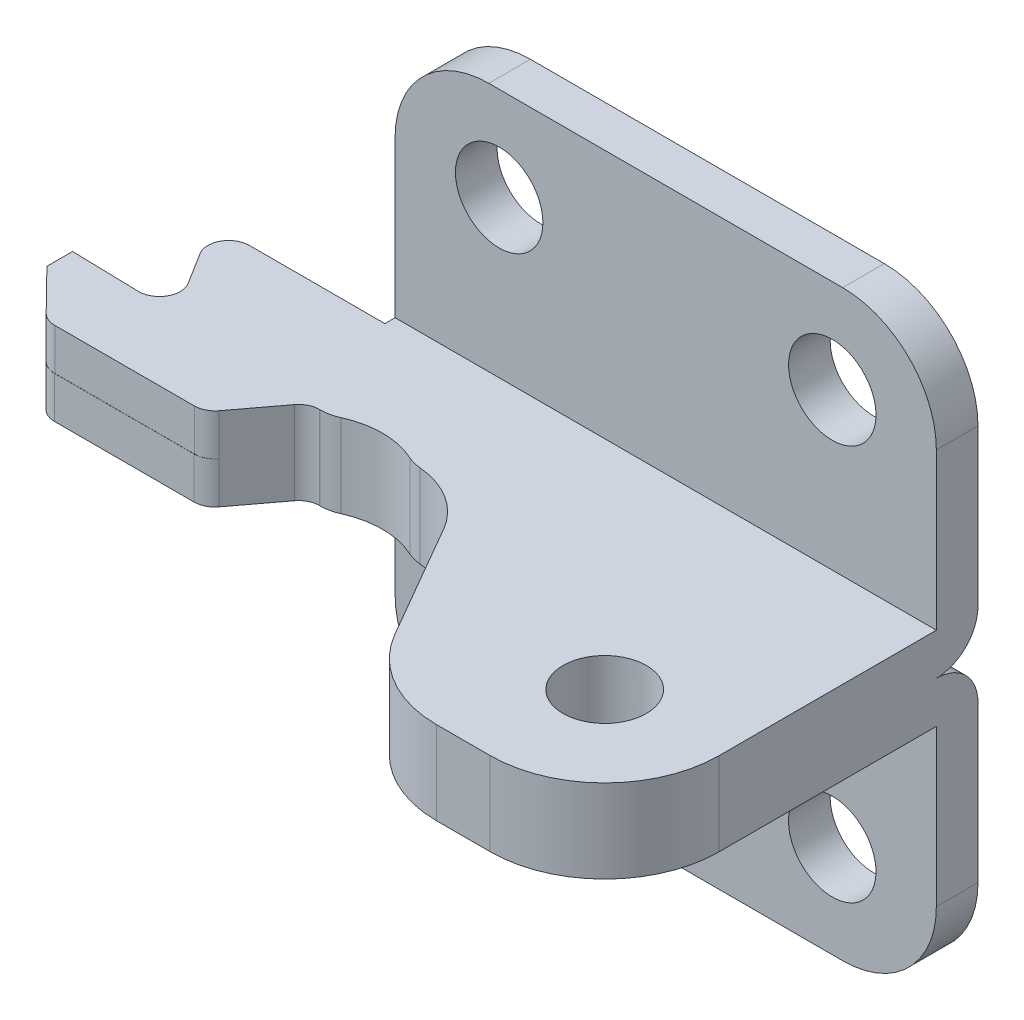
ISO-10303-21;
HEADER;
FILE_DESCRIPTION(('STEP AP214'),'2;1');
FILE_NAME('part.step','',(''),(''),'','','');
FILE_SCHEMA(('AUTOMOTIVE_DESIGN { 1 0 10303 214 1 1 1 1 }'));
ENDSEC;
DATA;
#1=APPLICATION_CONTEXT('core data for automotive mechanical design processes');
#2=APPLICATION_PROTOCOL_DEFINITION('international standard','automotive_design',2000,#1);
#3=PRODUCT_CONTEXT('',#1,'mechanical');
#4=PRODUCT('Part','Part','',(#3));
#5=PRODUCT_RELATED_PRODUCT_CATEGORY('part','',(#4));
#6=PRODUCT_DEFINITION_FORMATION('','',#4);
#7=PRODUCT_DEFINITION_CONTEXT('part definition',#1,'design');
#8=PRODUCT_DEFINITION('design','',#6,#7);
#9=PRODUCT_DEFINITION_SHAPE('','',#8);
#10=(LENGTH_UNIT() NAMED_UNIT(*) SI_UNIT(.MILLI.,.METRE.));
#11=(NAMED_UNIT(*) PLANE_ANGLE_UNIT() SI_UNIT($,.RADIAN.));
#12=(NAMED_UNIT(*) SI_UNIT($,.STERADIAN.) SOLID_ANGLE_UNIT());
#13=UNCERTAINTY_MEASURE_WITH_UNIT(LENGTH_MEASURE(1.E-05),#10,'distance_accuracy_value','');
#14=(GEOMETRIC_REPRESENTATION_CONTEXT(3) GLOBAL_UNCERTAINTY_ASSIGNED_CONTEXT((#13)) GLOBAL_UNIT_ASSIGNED_CONTEXT((#10,
#11,#12)) REPRESENTATION_CONTEXT('',''));
#15=CARTESIAN_POINT('',(0.,0.,0.));
#16=DIRECTION('',(0.,0.,1.));
#17=DIRECTION('',(1.,0.,0.));
#18=AXIS2_PLACEMENT_3D('',#15,#16,#17);
#19=CARTESIAN_POINT('',(-2.9655829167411,9.49825214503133,7.63174777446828));
#20=DIRECTION('',(0.,0.,1.));
#21=DIRECTION('',(0.,1.,0.));
#22=AXIS2_PLACEMENT_3D('',#19,#20,#21);
#23=PLANE('',#22);
#24=DIRECTION('',(0.,1.,0.));
#25=VECTOR('',#24,1.);
#26=CARTESIAN_POINT('',(-3.,9.49825214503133,7.63174777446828));
#27=LINE('',#26,#25);
#28=CARTESIAN_POINT('',(-3.,11.5,7.6317477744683));
#29=VERTEX_POINT('',#28);
#30=CARTESIAN_POINT('',(-3.,7.5,7.63174777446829));
#31=VERTEX_POINT('',#30);
#32=EDGE_CURVE('E327',#29,#31,#27,.F.);
#33=ORIENTED_EDGE('',*,*,#32,.T.);
#34=DIRECTION('',(-1.,0.,-1.00805955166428E-13));
#35=VECTOR('',#34,1.);
#36=CARTESIAN_POINT('',(-3.,7.5,7.63174777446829));
#37=LINE('',#36,#35);
#38=CARTESIAN_POINT('',(-2.9655829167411,7.5,7.63174777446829));
#39=VERTEX_POINT('',#38);
#40=EDGE_CURVE('E1279',#39,#31,#37,.T.);
#41=ORIENTED_EDGE('',*,*,#40,.F.);
#42=DIRECTION('',(0.,1.,0.));
#43=VECTOR('',#42,1.);
#44=CARTESIAN_POINT('',(-2.9655829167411,9.49825214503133,7.63174777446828));
#45=LINE('',#44,#43);
#46=CARTESIAN_POINT('',(-2.9655829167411,11.5,7.63174777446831));
#47=VERTEX_POINT('',#46);
#48=EDGE_CURVE('E325',#47,#39,#45,.F.);
#49=ORIENTED_EDGE('',*,*,#48,.F.);
#50=DIRECTION('',(1.,0.,0.));
#51=VECTOR('',#50,1.);
#52=CARTESIAN_POINT('',(21.6760275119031,11.5,7.6317477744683));
#53=LINE('',#52,#51);
#54=EDGE_CURVE('E651',#29,#47,#53,.T.);
#55=ORIENTED_EDGE('',*,*,#54,.F.);
#56=EDGE_LOOP('',(#33,#41,#49,#55));
#57=FACE_BOUND('',#56,.T.);
#58=ADVANCED_FACE('F14',(#57),#23,.T.);
#59=CARTESIAN_POINT('',(-18.1250262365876,11.5082521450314,2.01000000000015));
#60=DIRECTION('',(1.,0.,0.));
#61=DIRECTION('',(0.,1.,0.));
#62=AXIS2_PLACEMENT_3D('',#59,#60,#61);
#63=CYLINDRICAL_SURFACE('',#62,2.01);
#64=CARTESIAN_POINT('',(21.,11.5082521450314,2.01000000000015));
#65=DIRECTION('',(1.,0.,0.));
#66=DIRECTION('',(0.,1.,0.));
#67=AXIS2_PLACEMENT_3D('',#64,#65,#66);
#68=CIRCLE('',#67,2.01);
#69=CARTESIAN_POINT('',(21.0000000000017,9.53556991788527,1.6244810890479));
#70=VERTEX_POINT('',#69);
#71=CARTESIAN_POINT('',(21.,11.5082521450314,1.51891805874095E-13));
#72=VERTEX_POINT('',#71);
#73=EDGE_CURVE('E310',#70,#72,#68,.T.);
#74=ORIENTED_EDGE('',*,*,#73,.F.);
#75=DIRECTION('',(1.,0.,0.));
#76=VECTOR('',#75,1.);
#77=CARTESIAN_POINT('',(3.0879622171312,9.53556991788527,1.6244810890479));
#78=LINE('',#77,#76);
#79=CARTESIAN_POINT('',(-5.,9.53556991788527,1.6244810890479));
#80=VERTEX_POINT('',#79);
#81=EDGE_CURVE('E279',#70,#80,#78,.F.);
#82=ORIENTED_EDGE('',*,*,#81,.T.);
#83=CARTESIAN_POINT('',(-5.,11.5082521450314,2.01000000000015));
#84=DIRECTION('',(1.,0.,0.));
#85=DIRECTION('',(0.,1.,0.));
#86=AXIS2_PLACEMENT_3D('',#83,#84,#85);
#87=CIRCLE('',#86,2.01);
#88=CARTESIAN_POINT('',(-5.,11.5082521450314,1.6576959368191E-13));
#89=VERTEX_POINT('',#88);
#90=EDGE_CURVE('E331',#80,#89,#87,.T.);
#91=ORIENTED_EDGE('',*,*,#90,.T.);
#92=DIRECTION('',(1.,0.,0.));
#93=VECTOR('',#92,1.);
#94=CARTESIAN_POINT('',(-18.1250262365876,11.5082521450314,1.51891805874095E-13));
#95=LINE('',#94,#93);
#96=EDGE_CURVE('E324',#89,#72,#95,.T.);
#97=ORIENTED_EDGE('',*,*,#96,.T.);
#98=EDGE_LOOP('',(#74,#82,#91,#97));
#99=FACE_BOUND('',#98,.T.);
#100=ADVANCED_FACE('F884',(#99),#63,.T.);
#101=CARTESIAN_POINT('',(-5.,9.49825214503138,2.4917477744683));
#102=DIRECTION('',(-1.,0.,0.));
#103=DIRECTION('',(0.,-1.,0.));
#104=AXIS2_PLACEMENT_3D('',#101,#102,#103);
#105=PLANE('',#104);
#106=DIRECTION('',(0.,0.,1.));
#107=VECTOR('',#106,1.);
#108=CARTESIAN_POINT('',(-5.,11.5000000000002,-11.5682522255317));
#109=LINE('',#108,#107);
#110=CARTESIAN_POINT('',(-5.,11.5,2.00000000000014));
#111=VERTEX_POINT('',#110);
#112=CARTESIAN_POINT('',(-5.,11.5,2.49174777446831));
#113=VERTEX_POINT('',#112);
#114=EDGE_CURVE('E604',#111,#113,#109,.T.);
#115=ORIENTED_EDGE('',*,*,#114,.F.);
#116=DIRECTION('',(0.,1.,0.));
#117=VECTOR('',#116,1.);
#118=CARTESIAN_POINT('',(-5.,6.27794911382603,2.00000000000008));
#119=LINE('',#118,#117);
#120=CARTESIAN_POINT('',(-5.,19.,2.00000000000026));
#121=VERTEX_POINT('',#120);
#122=EDGE_CURVE('E321',#121,#111,#119,.F.);
#123=ORIENTED_EDGE('',*,*,#122,.F.);
#124=DIRECTION('',(0.,0.,1.));
#125=VECTOR('',#124,1.);
#126=CARTESIAN_POINT('',(-5.,19.,2.57982829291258E-13));
#127=LINE('',#126,#125);
#128=CARTESIAN_POINT('',(-5.,19.,2.57982829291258E-13));
#129=VERTEX_POINT('',#128);
#130=EDGE_CURVE('E336',#129,#121,#127,.T.);
#131=ORIENTED_EDGE('',*,*,#130,.F.);
#132=DIRECTION('',(0.,-1.,0.));
#133=VECTOR('',#132,1.);
#134=CARTESIAN_POINT('',(-5.,9.4400000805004,1.58265960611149E-13));
#135=LINE('',#134,#133);
#136=EDGE_CURVE('E349',#129,#89,#135,.T.);
#137=ORIENTED_EDGE('',*,*,#136,.T.);
#138=ORIENTED_EDGE('',*,*,#90,.F.);
#139=CARTESIAN_POINT('',(-5.,11.5,2.00000000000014));
#140=DIRECTION('',(-1.,0.,0.));
#141=DIRECTION('',(0.,-1.,0.));
#142=AXIS2_PLACEMENT_3D('',#139,#140,#141);
#143=CIRCLE('',#142,2.);
#144=CARTESIAN_POINT('',(-5.,9.5,2.00000000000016));
#145=VERTEX_POINT('',#144);
#146=EDGE_CURVE('E352',#80,#145,#143,.T.);
#147=ORIENTED_EDGE('',*,*,#146,.T.);
#148=CARTESIAN_POINT('',(-5.,7.5,2.00000000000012));
#149=DIRECTION('',(-1.,0.,0.));
#150=DIRECTION('',(0.,0.,1.));
#151=AXIS2_PLACEMENT_3D('',#148,#149,#150);
#152=CIRCLE('',#151,2.);
#153=CARTESIAN_POINT('',(-5.,9.46443008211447,1.62448108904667));
#154=VERTEX_POINT('',#153);
#155=EDGE_CURVE('E168',#145,#154,#152,.T.);
#156=ORIENTED_EDGE('',*,*,#155,.T.);
#157=CARTESIAN_POINT('',(-5.,7.49174785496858,2.01000000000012));
#158=DIRECTION('',(1.,0.,0.));
#159=DIRECTION('',(0.,1.,0.));
#160=AXIS2_PLACEMENT_3D('',#157,#158,#159);
#161=CIRCLE('',#160,2.01);
#162=CARTESIAN_POINT('',(-5.,7.49174785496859,1.16905812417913E-13));
#163=VERTEX_POINT('',#162);
#164=EDGE_CURVE('E201',#163,#154,#161,.T.);
#165=ORIENTED_EDGE('',*,*,#164,.F.);
#166=DIRECTION('',(0.,-1.,0.));
#167=VECTOR('',#166,1.);
#168=CARTESIAN_POINT('',(-5.,12.6999999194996,1.53274842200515E-13));
#169=LINE('',#168,#167);
#170=CARTESIAN_POINT('',(-5.,0.,0.));
#171=VERTEX_POINT('',#170);
#172=EDGE_CURVE('E178',#171,#163,#169,.F.);
#173=ORIENTED_EDGE('',*,*,#172,.F.);
#174=DIRECTION('',(0.,0.,1.));
#175=VECTOR('',#174,1.);
#176=CARTESIAN_POINT('',(-5.,0.,2.00000000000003));
#177=LINE('',#176,#175);
#178=CARTESIAN_POINT('',(-5.,0.,2.00000000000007));
#179=VERTEX_POINT('',#178);
#180=EDGE_CURVE('E185',#171,#179,#177,.T.);
#181=ORIENTED_EDGE('',*,*,#180,.T.);
#182=DIRECTION('',(0.,-1.,0.));
#183=VECTOR('',#182,1.);
#184=CARTESIAN_POINT('',(-5.,9.5599999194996,2.00000000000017));
#185=LINE('',#184,#183);
#186=CARTESIAN_POINT('',(-5.,7.5,2.00000000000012));
#187=VERTEX_POINT('',#186);
#188=EDGE_CURVE('E188',#179,#187,#185,.F.);
#189=ORIENTED_EDGE('',*,*,#188,.T.);
#190=DIRECTION('',(0.,0.,-1.));
#191=VECTOR('',#190,1.);
#192=CARTESIAN_POINT('',(-5.,7.5,2.00000000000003));
#193=LINE('',#192,#191);
#194=CARTESIAN_POINT('',(-5.,7.5,2.49174777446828));
#195=VERTEX_POINT('',#194);
#196=EDGE_CURVE('E1307',#195,#187,#193,.T.);
#197=ORIENTED_EDGE('',*,*,#196,.F.);
#198=DIRECTION('',(0.,1.,0.));
#199=VECTOR('',#198,1.);
#200=CARTESIAN_POINT('',(-5.,9.49825214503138,2.4917477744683));
#201=LINE('',#200,#199);
#202=EDGE_CURVE('E308',#113,#195,#201,.F.);
#203=ORIENTED_EDGE('',*,*,#202,.F.);
#204=EDGE_LOOP('',(#115,#123,#131,#137,#138,#147,#156,#165,#173,#181,#189,#197,#203));
#205=FACE_BOUND('',#204,.T.);
#206=ADVANCED_FACE('F252',(#205),#105,.T.);
#207=CARTESIAN_POINT('',(-11.5,9.49825214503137,3.49174777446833));
#208=DIRECTION('',(0.,1.,0.));
#209=DIRECTION('',(-1.,0.,0.));
#210=AXIS2_PLACEMENT_3D('',#207,#208,#209);
#211=CYLINDRICAL_SURFACE('',#210,1.00000000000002);
#212=DIRECTION('',(0.,1.,0.));
#213=VECTOR('',#212,1.);
#214=CARTESIAN_POINT('',(-11.5,9.49825214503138,2.4917477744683));
#215=LINE('',#214,#213);
#216=CARTESIAN_POINT('',(-11.5,7.5,2.49174777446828));
#217=VERTEX_POINT('',#216);
#218=CARTESIAN_POINT('',(-11.5,11.5,2.49174777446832));
#219=VERTEX_POINT('',#218);
#220=EDGE_CURVE('E305',#217,#219,#215,.T.);
#221=ORIENTED_EDGE('',*,*,#220,.F.);
#222=CARTESIAN_POINT('',(-11.5,7.5,3.49174777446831));
#223=DIRECTION('',(0.,-1.,0.));
#224=DIRECTION('',(0.,0.,1.));
#225=AXIS2_PLACEMENT_3D('',#222,#223,#224);
#226=CIRCLE('',#225,1.00000000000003);
#227=CARTESIAN_POINT('',(-12.3480480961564,7.5,4.02166703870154));
#228=VERTEX_POINT('',#227);
#229=EDGE_CURVE('E1247',#228,#217,#226,.T.);
#230=ORIENTED_EDGE('',*,*,#229,.F.);
#231=DIRECTION('',(0.,1.,0.));
#232=VECTOR('',#231,1.);
#233=CARTESIAN_POINT('',(-12.3480480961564,9.49825214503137,4.02166703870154));
#234=LINE('',#233,#232);
#235=CARTESIAN_POINT('',(-12.3480480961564,11.5,4.02166703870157));
#236=VERTEX_POINT('',#235);
#237=EDGE_CURVE('E303',#236,#228,#234,.F.);
#238=ORIENTED_EDGE('',*,*,#237,.F.);
#239=CARTESIAN_POINT('',(-11.5,11.5,3.49174777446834));
#240=DIRECTION('',(0.,1.,0.));
#241=DIRECTION('',(-1.,0.,0.));
#242=AXIS2_PLACEMENT_3D('',#239,#240,#241);
#243=CIRCLE('',#242,1.00000000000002);
#244=EDGE_CURVE('E596',#219,#236,#243,.T.);
#245=ORIENTED_EDGE('',*,*,#244,.F.);
#246=EDGE_LOOP('',(#221,#230,#238,#245));
#247=FACE_BOUND('',#246,.T.);
#248=ADVANCED_FACE('F880',(#247),#211,.T.);
#249=CARTESIAN_POINT('',(-15.5,9.49825214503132,8.2241751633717));
#250=DIRECTION('',(-1.,0.,0.));
#251=DIRECTION('',(0.,-1.,0.));
#252=AXIS2_PLACEMENT_3D('',#249,#250,#251);
#253=PLANE('',#252);
#254=DIRECTION('',(0.,1.,0.));
#255=VECTOR('',#254,1.);
#256=CARTESIAN_POINT('',(-15.5,9.49825214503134,6.99174777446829));
#257=LINE('',#256,#255);
#258=CARTESIAN_POINT('',(-15.5,9.5,6.99174777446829));
#259=VERTEX_POINT('',#258);
#260=CARTESIAN_POINT('',(-15.5,11.5,6.99174777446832));
#261=VERTEX_POINT('',#260);
#262=EDGE_CURVE('E290',#259,#261,#257,.T.);
#263=ORIENTED_EDGE('',*,*,#262,.F.);
#264=DIRECTION('',(0.,0.,1.));
#265=VECTOR('',#264,1.);
#266=CARTESIAN_POINT('',(-15.5,9.5,8.2241751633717));
#267=LINE('',#266,#265);
#268=CARTESIAN_POINT('',(-15.5,9.5,6.99663674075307));
#269=VERTEX_POINT('',#268);
#270=EDGE_CURVE('E397',#259,#269,#267,.T.);
#271=ORIENTED_EDGE('',*,*,#270,.T.);
#272=DIRECTION('',(0.,1.,0.));
#273=VECTOR('',#272,1.);
#274=CARTESIAN_POINT('',(-15.5,7.50174785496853,6.99663674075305));
#275=LINE('',#274,#273);
#276=CARTESIAN_POINT('',(-15.5,7.5,6.99663674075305));
#277=VERTEX_POINT('',#276);
#278=EDGE_CURVE('E225',#277,#269,#275,.T.);
#279=ORIENTED_EDGE('',*,*,#278,.F.);
#280=DIRECTION('',(0.,0.,-1.));
#281=VECTOR('',#280,1.);
#282=CARTESIAN_POINT('',(-15.5,7.5,6.99663674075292));
#283=LINE('',#282,#281);
#284=CARTESIAN_POINT('',(-15.5,7.5,8.23281309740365));
#285=VERTEX_POINT('',#284);
#286=EDGE_CURVE('E1259',#285,#277,#283,.T.);
#287=ORIENTED_EDGE('',*,*,#286,.F.);
#288=DIRECTION('',(0.,1.,0.));
#289=VECTOR('',#288,1.);
#290=CARTESIAN_POINT('',(-15.5,7.50174785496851,8.23281309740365));
#291=LINE('',#290,#289);
#292=CARTESIAN_POINT('',(-15.5,9.5,8.23281309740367));
#293=VERTEX_POINT('',#292);
#294=EDGE_CURVE('E221',#293,#285,#291,.F.);
#295=ORIENTED_EDGE('',*,*,#294,.F.);
#296=DIRECTION('',(0.,0.,1.));
#297=VECTOR('',#296,1.);
#298=CARTESIAN_POINT('',(-15.5,9.5,8.23281309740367));
#299=LINE('',#298,#297);
#300=CARTESIAN_POINT('',(-15.5,9.5,8.2241751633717));
#301=VERTEX_POINT('',#300);
#302=EDGE_CURVE('E474',#301,#293,#299,.T.);
#303=ORIENTED_EDGE('',*,*,#302,.F.);
#304=DIRECTION('',(0.,1.,0.));
#305=VECTOR('',#304,1.);
#306=CARTESIAN_POINT('',(-15.5,9.49825214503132,8.2241751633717));
#307=LINE('',#306,#305);
#308=CARTESIAN_POINT('',(-15.5,11.5,8.22417516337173));
#309=VERTEX_POINT('',#308);
#310=EDGE_CURVE('E293',#309,#301,#307,.F.);
#311=ORIENTED_EDGE('',*,*,#310,.F.);
#312=DIRECTION('',(0.,0.,1.));
#313=VECTOR('',#312,1.);
#314=CARTESIAN_POINT('',(-15.5,11.5000000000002,-11.5682522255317));
#315=LINE('',#314,#313);
#316=EDGE_CURVE('E471',#261,#309,#315,.T.);
#317=ORIENTED_EDGE('',*,*,#316,.F.);
#318=EDGE_LOOP('',(#263,#271,#279,#287,#295,#303,#311,#317));
#319=FACE_BOUND('',#318,.T.);
#320=ADVANCED_FACE('F409',(#319),#253,.T.);
#321=CARTESIAN_POINT('',(-12.8523277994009,9.49825214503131,9.49174777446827));
#322=DIRECTION('',(0.,1.,0.));
#323=DIRECTION('',(-1.,0.,0.));
#324=AXIS2_PLACEMENT_3D('',#321,#322,#323);
#325=CYLINDRICAL_SURFACE('',#324,1.00000000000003);
#326=DIRECTION('',(0.,1.,0.));
#327=VECTOR('',#326,1.);
#328=CARTESIAN_POINT('',(-13.565578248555,9.4982521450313,10.1926570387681));
#329=LINE('',#328,#327);
#330=CARTESIAN_POINT('',(-13.565578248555,9.4999999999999,10.1926570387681));
#331=VERTEX_POINT('',#330);
#332=CARTESIAN_POINT('',(-13.565578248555,11.5,10.1926570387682));
#333=VERTEX_POINT('',#332);
#334=EDGE_CURVE('E449',#331,#333,#329,.T.);
#335=ORIENTED_EDGE('',*,*,#334,.F.);
#336=CARTESIAN_POINT('',(-12.8523277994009,9.4999999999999,9.49174777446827));
#337=DIRECTION('',(0.,-1.,0.));
#338=DIRECTION('',(0.,0.,1.));
#339=AXIS2_PLACEMENT_3D('',#336,#337,#338);
#340=CIRCLE('',#339,1.00000000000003);
#341=CARTESIAN_POINT('',(-12.8523277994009,9.49999999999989,10.4917477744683));
#342=VERTEX_POINT('',#341);
#343=EDGE_CURVE('E417',#331,#342,#340,.F.);
#344=ORIENTED_EDGE('',*,*,#343,.T.);
#345=DIRECTION('',(0.,1.,0.));
#346=VECTOR('',#345,1.);
#347=CARTESIAN_POINT('',(-12.8523277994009,9.4982521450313,10.4917477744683));
#348=LINE('',#347,#346);
#349=CARTESIAN_POINT('',(-12.8523277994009,11.5,10.4917477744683));
#350=VERTEX_POINT('',#349);
#351=EDGE_CURVE('E446',#350,#342,#348,.F.);
#352=ORIENTED_EDGE('',*,*,#351,.F.);
#353=CARTESIAN_POINT('',(-12.8523277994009,11.5,9.4917477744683));
#354=DIRECTION('',(0.,1.,0.));
#355=DIRECTION('',(-1.,0.,0.));
#356=AXIS2_PLACEMENT_3D('',#353,#354,#355);
#357=CIRCLE('',#356,1.00000000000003);
#358=EDGE_CURVE('E639',#333,#350,#357,.T.);
#359=ORIENTED_EDGE('',*,*,#358,.F.);
#360=EDGE_LOOP('',(#335,#344,#352,#359));
#361=FACE_BOUND('',#360,.T.);
#362=ADVANCED_FACE('F623',(#361),#325,.T.);
#363=CARTESIAN_POINT('',(-6.15232779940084,9.49825214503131,9.49174777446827));
#364=DIRECTION('',(0.,1.,0.));
#365=DIRECTION('',(-1.,0.,0.));
#366=AXIS2_PLACEMENT_3D('',#363,#364,#365);
#367=CYLINDRICAL_SURFACE('',#366,1.00000000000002);
#368=DIRECTION('',(0.,1.,0.));
#369=VECTOR('',#368,1.);
#370=CARTESIAN_POINT('',(-6.15232779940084,9.4982521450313,10.4917477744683));
#371=LINE('',#370,#369);
#372=CARTESIAN_POINT('',(-6.15232779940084,9.49999999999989,10.4917477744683));
#373=VERTEX_POINT('',#372);
#374=CARTESIAN_POINT('',(-6.15232779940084,11.5,10.4917477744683));
#375=VERTEX_POINT('',#374);
#376=EDGE_CURVE('E443',#373,#375,#371,.T.);
#377=ORIENTED_EDGE('',*,*,#376,.F.);
#378=CARTESIAN_POINT('',(-6.15232779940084,9.4999999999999,9.49174777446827));
#379=DIRECTION('',(0.,-1.,0.));
#380=DIRECTION('',(0.,0.,1.));
#381=AXIS2_PLACEMENT_3D('',#378,#379,#380);
#382=CIRCLE('',#381,1.00000000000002);
#383=CARTESIAN_POINT('',(-5.35369228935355,9.4999999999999,10.0935627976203));
#384=VERTEX_POINT('',#383);
#385=EDGE_CURVE('E616',#373,#384,#382,.F.);
#386=ORIENTED_EDGE('',*,*,#385,.T.);
#387=DIRECTION('',(0.,1.,0.));
#388=VECTOR('',#387,1.);
#389=CARTESIAN_POINT('',(-5.35369228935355,9.49825214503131,10.0935627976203));
#390=LINE('',#389,#388);
#391=CARTESIAN_POINT('',(-5.35369228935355,11.5,10.0935627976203));
#392=VERTEX_POINT('',#391);
#393=EDGE_CURVE('E440',#392,#384,#390,.F.);
#394=ORIENTED_EDGE('',*,*,#393,.F.);
#395=CARTESIAN_POINT('',(-6.15232779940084,11.5,9.4917477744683));
#396=DIRECTION('',(0.,1.,0.));
#397=DIRECTION('',(-1.,0.,0.));
#398=AXIS2_PLACEMENT_3D('',#395,#396,#397);
#399=CIRCLE('',#398,1.00000000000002);
#400=EDGE_CURVE('E638',#375,#392,#399,.T.);
#401=ORIENTED_EDGE('',*,*,#400,.F.);
#402=EDGE_LOOP('',(#377,#386,#394,#401));
#403=FACE_BOUND('',#402,.T.);
#404=ADVANCED_FACE('F871',(#403),#367,.T.);
#405=CARTESIAN_POINT('',(-3.,9.49825214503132,8.6317477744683));
#406=DIRECTION('',(0.,1.,0.));
#407=DIRECTION('',(-1.,0.,0.));
#408=AXIS2_PLACEMENT_3D('',#405,#406,#407);
#409=CYLINDRICAL_SURFACE('',#408,1.00000000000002);
#410=DIRECTION('',(0.,1.,0.));
#411=VECTOR('',#410,1.);
#412=CARTESIAN_POINT('',(-3.7986355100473,9.49825214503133,8.02993275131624));
#413=LINE('',#412,#411);
#414=CARTESIAN_POINT('',(-3.7986355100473,7.5,8.02993275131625));
#415=VERTEX_POINT('',#414);
#416=CARTESIAN_POINT('',(-3.7986355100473,11.5,8.02993275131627));
#417=VERTEX_POINT('',#416);
#418=EDGE_CURVE('E439',#415,#417,#413,.T.);
#419=ORIENTED_EDGE('',*,*,#418,.F.);
#420=CARTESIAN_POINT('',(-3.,7.5,8.63174777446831));
#421=DIRECTION('',(0.,-1.,0.));
#422=DIRECTION('',(0.,0.,1.));
#423=AXIS2_PLACEMENT_3D('',#420,#421,#422);
#424=CIRCLE('',#423,1.00000000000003);
#425=EDGE_CURVE('E1276',#31,#415,#424,.F.);
#426=ORIENTED_EDGE('',*,*,#425,.F.);
#427=ORIENTED_EDGE('',*,*,#32,.F.);
#428=CARTESIAN_POINT('',(-3.,11.5,8.63174777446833));
#429=DIRECTION('',(0.,1.,0.));
#430=DIRECTION('',(-1.,0.,0.));
#431=AXIS2_PLACEMENT_3D('',#428,#429,#430);
#432=CIRCLE('',#431,1.00000000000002);
#433=EDGE_CURVE('E648',#417,#29,#432,.F.);
#434=ORIENTED_EDGE('',*,*,#433,.F.);
#435=EDGE_LOOP('',(#419,#426,#427,#434));
#436=FACE_BOUND('',#435,.T.);
#437=ADVANCED_FACE('F867',(#436),#409,.F.);
#438=CARTESIAN_POINT('',(-2.9655829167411,9.49825214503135,5.63174777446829));
#439=DIRECTION('',(0.,1.,0.));
#440=DIRECTION('',(-1.,0.,0.));
#441=AXIS2_PLACEMENT_3D('',#438,#439,#440);
#442=CYLINDRICAL_SURFACE('',#441,2.);
#443=ORIENTED_EDGE('',*,*,#48,.T.);
#444=CARTESIAN_POINT('',(-2.9655829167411,7.5,5.63174777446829));
#445=DIRECTION('',(0.,-1.,0.));
#446=DIRECTION('',(0.,0.,1.));
#447=AXIS2_PLACEMENT_3D('',#444,#445,#446);
#448=CIRCLE('',#447,2.);
#449=CARTESIAN_POINT('',(-2.14372194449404,7.5,7.45508113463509));
#450=VERTEX_POINT('',#449);
#451=EDGE_CURVE('E1282',#450,#39,#448,.T.);
#452=ORIENTED_EDGE('',*,*,#451,.F.);
#453=DIRECTION('',(0.,1.,0.));
#454=VECTOR('',#453,1.);
#455=CARTESIAN_POINT('',(-2.14372194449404,9.49825214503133,7.45508113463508));
#456=LINE('',#455,#454);
#457=CARTESIAN_POINT('',(-2.14372194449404,11.5,7.45508113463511));
#458=VERTEX_POINT('',#457);
#459=EDGE_CURVE('E434',#450,#458,#456,.T.);
#460=ORIENTED_EDGE('',*,*,#459,.T.);
#461=CARTESIAN_POINT('',(-2.9655829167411,11.5,5.63174777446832));
#462=DIRECTION('',(0.,1.,0.));
#463=DIRECTION('',(-1.,0.,0.));
#464=AXIS2_PLACEMENT_3D('',#461,#462,#463);
#465=CIRCLE('',#464,2.);
#466=EDGE_CURVE('E654',#47,#458,#465,.T.);
#467=ORIENTED_EDGE('',*,*,#466,.F.);
#468=EDGE_LOOP('',(#443,#452,#460,#467));
#469=FACE_BOUND('',#468,.T.);
#470=ADVANCED_FACE('F863',(#469),#442,.T.);
#471=CARTESIAN_POINT('',(2.01393127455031,9.49825214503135,5.65379874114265));
#472=DIRECTION('',(0.,1.,0.));
#473=DIRECTION('',(-1.,0.,0.));
#474=AXIS2_PLACEMENT_3D('',#471,#472,#473);
#475=CYLINDRICAL_SURFACE('',#474,2.);
#476=DIRECTION('',(0.,1.,0.));
#477=VECTOR('',#476,1.);
#478=CARTESIAN_POINT('',(1.17595418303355,9.49825214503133,7.46978177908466));
#479=LINE('',#478,#477);
#480=CARTESIAN_POINT('',(1.17595418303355,11.5,7.46978177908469));
#481=VERTEX_POINT('',#480);
#482=CARTESIAN_POINT('',(1.17595418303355,7.5,7.46978177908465));
#483=VERTEX_POINT('',#482);
#484=EDGE_CURVE('E437',#481,#483,#479,.F.);
#485=ORIENTED_EDGE('',*,*,#484,.T.);
#486=CARTESIAN_POINT('',(2.01393127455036,7.5,5.65379874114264));
#487=DIRECTION('',(0.,-1.,0.));
#488=DIRECTION('',(0.,0.,1.));
#489=AXIS2_PLACEMENT_3D('',#486,#487,#488);
#490=CIRCLE('',#489,2.);
#491=CARTESIAN_POINT('',(1.84262084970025,7.5,7.64644841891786));
#492=VERTEX_POINT('',#491);
#493=EDGE_CURVE('E1288',#492,#483,#490,.T.);
#494=ORIENTED_EDGE('',*,*,#493,.F.);
#495=DIRECTION('',(0.,1.,0.));
#496=VECTOR('',#495,1.);
#497=CARTESIAN_POINT('',(1.8426208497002,9.49825214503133,7.64644841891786));
#498=LINE('',#497,#496);
#499=CARTESIAN_POINT('',(1.8426208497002,11.5,7.64644841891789));
#500=VERTEX_POINT('',#499);
#501=EDGE_CURVE('E431',#492,#500,#498,.T.);
#502=ORIENTED_EDGE('',*,*,#501,.T.);
#503=CARTESIAN_POINT('',(2.01393127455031,11.5,5.65379874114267));
#504=DIRECTION('',(0.,1.,0.));
#505=DIRECTION('',(-1.,0.,0.));
#506=AXIS2_PLACEMENT_3D('',#503,#504,#505);
#507=CIRCLE('',#506,2.);
#508=EDGE_CURVE('E660',#481,#500,#507,.T.);
#509=ORIENTED_EDGE('',*,*,#508,.F.);
#510=EDGE_LOOP('',(#485,#494,#502,#509));
#511=FACE_BOUND('',#510,.T.);
#512=ADVANCED_FACE('F859',(#511),#475,.T.);
#513=CARTESIAN_POINT('',(-11.5,9.49825214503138,2.4917477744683));
#514=DIRECTION('',(0.,0.,-1.));
#515=DIRECTION('',(-1.,0.,0.));
#516=AXIS2_PLACEMENT_3D('',#513,#514,#515);
#517=PLANE('',#516);
#518=ORIENTED_EDGE('',*,*,#202,.T.);
#519=DIRECTION('',(1.,0.,0.));
#520=VECTOR('',#519,1.);
#521=CARTESIAN_POINT('',(-5.,7.5,2.49174777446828));
#522=LINE('',#521,#520);
#523=EDGE_CURVE('E1244',#217,#195,#522,.T.);
#524=ORIENTED_EDGE('',*,*,#523,.F.);
#525=ORIENTED_EDGE('',*,*,#220,.T.);
#526=DIRECTION('',(-1.,0.,0.));
#527=VECTOR('',#526,1.);
#528=CARTESIAN_POINT('',(21.6760275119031,11.5,2.49174777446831));
#529=LINE('',#528,#527);
#530=EDGE_CURVE('E601',#113,#219,#529,.T.);
#531=ORIENTED_EDGE('',*,*,#530,.F.);
#532=EDGE_LOOP('',(#518,#524,#525,#531));
#533=FACE_BOUND('',#532,.T.);
#534=ADVANCED_FACE('F855',(#533),#517,.T.);
#535=CARTESIAN_POINT('',(-11.3986390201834,9.49825214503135,5.54103916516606));
#536=DIRECTION('',(-0.848048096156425,0.,0.529919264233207));
#537=DIRECTION('',(0.529919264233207,0.,0.848048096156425));
#538=AXIS2_PLACEMENT_3D('',#535,#536,#537);
#539=PLANE('',#538);
#540=ORIENTED_EDGE('',*,*,#237,.T.);
#541=DIRECTION('',(-0.529919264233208,0.,-0.848048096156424));
#542=VECTOR('',#541,1.);
#543=CARTESIAN_POINT('',(-12.3480480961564,7.5,4.02166703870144));
#544=LINE('',#543,#542);
#545=CARTESIAN_POINT('',(-11.3919519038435,7.5,5.55174078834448));
#546=VERTEX_POINT('',#545);
#547=EDGE_CURVE('E1250',#546,#228,#544,.T.);
#548=ORIENTED_EDGE('',*,*,#547,.F.);
#549=DIRECTION('',(0.,1.,0.));
#550=VECTOR('',#549,1.);
#551=CARTESIAN_POINT('',(-11.3919519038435,7.50174785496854,5.55174078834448));
#552=LINE('',#551,#550);
#553=CARTESIAN_POINT('',(-11.3919519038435,9.5,5.55174078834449));
#554=VERTEX_POINT('',#553);
#555=EDGE_CURVE('E204',#546,#554,#552,.T.);
#556=ORIENTED_EDGE('',*,*,#555,.T.);
#557=DIRECTION('',(-0.52991926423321,0.,-0.848048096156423));
#558=VECTOR('',#557,1.);
#559=CARTESIAN_POINT('',(-20.2392539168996,9.5,-8.60690211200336));
#560=LINE('',#559,#558);
#561=CARTESIAN_POINT('',(-11.3986390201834,9.5,5.54103916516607));
#562=VERTEX_POINT('',#561);
#563=EDGE_CURVE('E9',#554,#562,#560,.T.);
#564=ORIENTED_EDGE('',*,*,#563,.T.);
#565=DIRECTION('',(0.,1.,0.));
#566=VECTOR('',#565,1.);
#567=CARTESIAN_POINT('',(-11.3986390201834,9.49825214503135,5.54103916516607));
#568=LINE('',#567,#566);
#569=CARTESIAN_POINT('',(-11.3986390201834,11.5,5.54103916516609));
#570=VERTEX_POINT('',#569);
#571=EDGE_CURVE('E300',#562,#570,#568,.T.);
#572=ORIENTED_EDGE('',*,*,#571,.T.);
#573=DIRECTION('',(0.529919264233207,0.,0.848048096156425));
#574=VECTOR('',#573,1.);
#575=CARTESIAN_POINT('',(-9.79966012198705,11.5,8.09994030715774));
#576=LINE('',#575,#574);
#577=EDGE_CURVE('E594',#236,#570,#576,.T.);
#578=ORIENTED_EDGE('',*,*,#577,.F.);
#579=EDGE_LOOP('',(#540,#548,#556,#564,#572,#578));
#580=FACE_BOUND('',#579,.T.);
#581=ADVANCED_FACE('F852',(#580),#539,.T.);
#582=CARTESIAN_POINT('',(-12.2466871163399,9.49825214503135,6.07095842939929));
#583=DIRECTION('',(0.,1.,0.));
#584=DIRECTION('',(-1.,0.,0.));
#585=AXIS2_PLACEMENT_3D('',#582,#583,#584);
#586=CYLINDRICAL_SURFACE('',#585,1.00000000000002);
#587=CARTESIAN_POINT('',(-12.2466871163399,9.5,6.07095842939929));
#588=DIRECTION('',(0.,-1.,0.));
#589=DIRECTION('',(0.,0.,1.));
#590=AXIS2_PLACEMENT_3D('',#587,#588,#589);
#591=CIRCLE('',#590,1.00000000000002);
#592=CARTESIAN_POINT('',(-12.2711192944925,9.5,7.07065991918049));
#593=VERTEX_POINT('',#592);
#594=EDGE_CURVE('E414',#593,#562,#591,.F.);
#595=ORIENTED_EDGE('',*,*,#594,.F.);
#596=DIRECTION('',(0.,1.,0.));
#597=VECTOR('',#596,1.);
#598=CARTESIAN_POINT('',(-12.2711192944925,9.49825214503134,7.07065991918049));
#599=LINE('',#598,#597);
#600=CARTESIAN_POINT('',(-12.2711192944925,11.5,7.07065991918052));
#601=VERTEX_POINT('',#600);
#602=EDGE_CURVE('E294',#601,#593,#599,.F.);
#603=ORIENTED_EDGE('',*,*,#602,.F.);
#604=CARTESIAN_POINT('',(-12.2466871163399,11.5,6.07095842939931));
#605=DIRECTION('',(0.,1.,0.));
#606=DIRECTION('',(-1.,0.,0.));
#607=AXIS2_PLACEMENT_3D('',#604,#605,#606);
#608=CIRCLE('',#607,1.00000000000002);
#609=EDGE_CURVE('E584',#570,#601,#608,.F.);
#610=ORIENTED_EDGE('',*,*,#609,.F.);
#611=ORIENTED_EDGE('',*,*,#571,.F.);
#612=EDGE_LOOP('',(#595,#603,#610,#611));
#613=FACE_BOUND('',#612,.T.);
#614=ADVANCED_FACE('F581',(#613),#586,.F.);
#615=CARTESIAN_POINT('',(-15.5,9.49825214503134,6.99174777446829));
#616=DIRECTION('',(0.0244321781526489,0.,-0.999701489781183));
#617=DIRECTION('',(-0.999701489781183,0.,-0.0244321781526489));
#618=AXIS2_PLACEMENT_3D('',#615,#616,#617);
#619=PLANE('',#618);
#620=ORIENTED_EDGE('',*,*,#602,.T.);
#621=DIRECTION('',(-0.999701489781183,0.,-0.0244321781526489));
#622=VECTOR('',#621,1.);
#623=CARTESIAN_POINT('',(-15.5,9.5,6.99174777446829));
#624=LINE('',#623,#622);
#625=EDGE_CURVE('E411',#593,#259,#624,.T.);
#626=ORIENTED_EDGE('',*,*,#625,.T.);
#627=ORIENTED_EDGE('',*,*,#262,.T.);
#628=DIRECTION('',(-0.999701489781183,0.,-0.0244321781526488));
#629=VECTOR('',#628,1.);
#630=CARTESIAN_POINT('',(21.2005101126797,11.5,7.8886889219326));
#631=LINE('',#630,#629);
#632=EDGE_CURVE('E587',#601,#261,#631,.T.);
#633=ORIENTED_EDGE('',*,*,#632,.F.);
#634=EDGE_LOOP('',(#620,#626,#627,#633));
#635=FACE_BOUND('',#634,.T.);
#636=ADVANCED_FACE('F588',(#635),#619,.T.);
#637=CARTESIAN_POINT('',(-13.565578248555,9.4982521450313,10.1926570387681));
#638=DIRECTION('',(-0.713250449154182,0.,0.70090926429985));
#639=DIRECTION('',(0.70090926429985,0.,0.713250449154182));
#640=AXIS2_PLACEMENT_3D('',#637,#638,#639);
#641=PLANE('',#640);
#642=ORIENTED_EDGE('',*,*,#310,.T.);
#643=DIRECTION('',(0.70090926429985,0.,0.713250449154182));
#644=VECTOR('',#643,1.);
#645=CARTESIAN_POINT('',(-13.565578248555,9.4999999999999,10.1926570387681));
#646=LINE('',#645,#644);
#647=EDGE_CURVE('E412',#301,#331,#646,.T.);
#648=ORIENTED_EDGE('',*,*,#647,.T.);
#649=ORIENTED_EDGE('',*,*,#334,.T.);
#650=DIRECTION('',(0.700909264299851,0.,0.713250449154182));
#651=VECTOR('',#650,1.);
#652=CARTESIAN_POINT('',(-7.1310982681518,11.4999999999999,16.7404314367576));
#653=LINE('',#652,#651);
#654=EDGE_CURVE('E466',#309,#333,#653,.T.);
#655=ORIENTED_EDGE('',*,*,#654,.F.);
#656=EDGE_LOOP('',(#642,#648,#649,#655));
#657=FACE_BOUND('',#656,.T.);
#658=ADVANCED_FACE('F460',(#657),#641,.T.);
#659=CARTESIAN_POINT('',(-6.15232779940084,9.4982521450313,10.4917477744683));
#660=DIRECTION('',(0.,0.,1.));
#661=DIRECTION('',(1.,0.,0.));
#662=AXIS2_PLACEMENT_3D('',#659,#660,#661);
#663=PLANE('',#662);
#664=ORIENTED_EDGE('',*,*,#351,.T.);
#665=DIRECTION('',(1.,0.,0.));
#666=VECTOR('',#665,1.);
#667=CARTESIAN_POINT('',(-6.15232779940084,9.49999999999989,10.4917477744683));
#668=LINE('',#667,#666);
#669=EDGE_CURVE('E619',#342,#373,#668,.T.);
#670=ORIENTED_EDGE('',*,*,#669,.T.);
#671=ORIENTED_EDGE('',*,*,#376,.T.);
#672=DIRECTION('',(1.,0.,0.));
#673=VECTOR('',#672,1.);
#674=CARTESIAN_POINT('',(21.6760275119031,11.5,10.4917477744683));
#675=LINE('',#674,#673);
#676=EDGE_CURVE('E634',#350,#375,#675,.T.);
#677=ORIENTED_EDGE('',*,*,#676,.F.);
#678=EDGE_LOOP('',(#664,#670,#671,#677));
#679=FACE_BOUND('',#678,.T.);
#680=ADVANCED_FACE('F632',(#679),#663,.T.);
#681=CARTESIAN_POINT('',(-3.7986355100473,9.49825214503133,8.02993275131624));
#682=DIRECTION('',(0.798635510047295,0.,0.601815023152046));
#683=DIRECTION('',(0.601815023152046,0.,-0.798635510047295));
#684=AXIS2_PLACEMENT_3D('',#681,#682,#683);
#685=PLANE('',#684);
#686=ORIENTED_EDGE('',*,*,#393,.T.);
#687=DIRECTION('',(0.601815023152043,0.,-0.798635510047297));
#688=VECTOR('',#687,1.);
#689=CARTESIAN_POINT('',(-3.7986355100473,9.5,8.02993275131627));
#690=LINE('',#689,#688);
#691=CARTESIAN_POINT('',(-5.35737638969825,9.4999999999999,10.0984517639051));
#692=VERTEX_POINT('',#691);
#693=EDGE_CURVE('E1311',#692,#384,#690,.T.);
#694=ORIENTED_EDGE('',*,*,#693,.F.);
#695=DIRECTION('',(0.,1.,0.));
#696=VECTOR('',#695,1.);
#697=CARTESIAN_POINT('',(-5.35737638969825,7.5017478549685,10.0984517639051));
#698=LINE('',#697,#696);
#699=CARTESIAN_POINT('',(-5.35737638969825,7.5,10.0984517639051));
#700=VERTEX_POINT('',#699);
#701=EDGE_CURVE('E220',#692,#700,#698,.F.);
#702=ORIENTED_EDGE('',*,*,#701,.T.);
#703=DIRECTION('',(-0.601815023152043,0.,0.798635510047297));
#704=VECTOR('',#703,1.);
#705=CARTESIAN_POINT('',(-5.35737638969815,7.5,10.098451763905));
#706=LINE('',#705,#704);
#707=EDGE_CURVE('E1273',#415,#700,#706,.T.);
#708=ORIENTED_EDGE('',*,*,#707,.F.);
#709=ORIENTED_EDGE('',*,*,#418,.T.);
#710=DIRECTION('',(0.601815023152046,0.,-0.798635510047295));
#711=VECTOR('',#710,1.);
#712=CARTESIAN_POINT('',(14.8473038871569,11.5000000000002,-16.7140645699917));
#713=LINE('',#712,#711);
#714=EDGE_CURVE('E645',#392,#417,#713,.T.);
#715=ORIENTED_EDGE('',*,*,#714,.F.);
#716=EDGE_LOOP('',(#686,#694,#702,#708,#709,#715));
#717=FACE_BOUND('',#716,.T.);
#718=ADVANCED_FACE('F839',(#717),#685,.T.);
#719=CARTESIAN_POINT('',(-0.5,9.49825214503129,11.1017478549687));
#720=DIRECTION('',(0.,1.,0.));
#721=DIRECTION('',(-1.,0.,0.));
#722=AXIS2_PLACEMENT_3D('',#719,#720,#721);
#723=CYLINDRICAL_SURFACE('',#722,4.);
#724=ORIENTED_EDGE('',*,*,#459,.F.);
#725=CARTESIAN_POINT('',(-0.499999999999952,7.49999999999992,11.1017478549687));
#726=DIRECTION('',(0.,-1.,0.));
#727=DIRECTION('',(0.,0.,1.));
#728=AXIS2_PLACEMENT_3D('',#725,#726,#727);
#729=CIRCLE('',#728,4.);
#730=EDGE_CURVE('E1285',#483,#450,#729,.F.);
#731=ORIENTED_EDGE('',*,*,#730,.F.);
#732=ORIENTED_EDGE('',*,*,#484,.F.);
#733=CARTESIAN_POINT('',(-0.5,11.5,11.1017478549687));
#734=DIRECTION('',(0.,1.,0.));
#735=DIRECTION('',(-1.,0.,0.));
#736=AXIS2_PLACEMENT_3D('',#733,#734,#735);
#737=CIRCLE('',#736,4.);
#738=EDGE_CURVE('E657',#458,#481,#737,.F.);
#739=ORIENTED_EDGE('',*,*,#738,.F.);
#740=EDGE_LOOP('',(#724,#731,#732,#739));
#741=FACE_BOUND('',#740,.T.);
#742=ADVANCED_FACE('F835',(#741),#723,.F.);
#743=CARTESIAN_POINT('',(1.5,9.49825214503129,11.6317477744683));
#744=DIRECTION('',(0.,1.,0.));
#745=DIRECTION('',(-1.,0.,0.));
#746=AXIS2_PLACEMENT_3D('',#743,#744,#745);
#747=CYLINDRICAL_SURFACE('',#746,4.);
#748=ORIENTED_EDGE('',*,*,#501,.F.);
#749=CARTESIAN_POINT('',(1.5,7.5,11.6317477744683));
#750=DIRECTION('',(0.,-1.,0.));
#751=DIRECTION('',(0.,0.,1.));
#752=AXIS2_PLACEMENT_3D('',#749,#750,#751);
#753=CIRCLE('',#752,4.);
#754=CARTESIAN_POINT('',(4.96406933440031,7.5,9.63169186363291));
#755=VERTEX_POINT('',#754);
#756=EDGE_CURVE('E1291',#755,#492,#753,.F.);
#757=ORIENTED_EDGE('',*,*,#756,.F.);
#758=DIRECTION('',(0.,1.,0.));
#759=VECTOR('',#758,1.);
#760=CARTESIAN_POINT('',(4.96406933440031,9.49825214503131,9.63169186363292));
#761=LINE('',#760,#759);
#762=CARTESIAN_POINT('',(4.96406933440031,11.5,9.63169186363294));
#763=VERTEX_POINT('',#762);
#764=EDGE_CURVE('E429',#763,#755,#761,.F.);
#765=ORIENTED_EDGE('',*,*,#764,.F.);
#766=CARTESIAN_POINT('',(1.5,11.5,11.6317477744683));
#767=DIRECTION('',(0.,1.,0.));
#768=DIRECTION('',(-1.,0.,0.));
#769=AXIS2_PLACEMENT_3D('',#766,#767,#768);
#770=CIRCLE('',#769,4.);
#771=EDGE_CURVE('E663',#500,#763,#770,.F.);
#772=ORIENTED_EDGE('',*,*,#771,.F.);
#773=EDGE_LOOP('',(#748,#757,#765,#772));
#774=FACE_BOUND('',#773,.T.);
#775=ADVANCED_FACE('F831',(#774),#747,.F.);
#776=CARTESIAN_POINT('',(8.16855948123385,9.49825214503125,15.1818247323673));
#777=DIRECTION('',(-0.866017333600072,0.,0.500013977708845));
#778=DIRECTION('',(0.500013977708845,0.,0.866017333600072));
#779=AXIS2_PLACEMENT_3D('',#776,#777,#778);
#780=PLANE('',#779);
#781=ORIENTED_EDGE('',*,*,#764,.T.);
#782=DIRECTION('',(-0.500013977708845,0.,-0.866017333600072));
#783=VECTOR('',#782,1.);
#784=CARTESIAN_POINT('',(4.96406933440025,7.5,9.6316918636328));
#785=LINE('',#784,#783);
#786=CARTESIAN_POINT('',(8.16855948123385,7.49999999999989,15.1818247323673));
#787=VERTEX_POINT('',#786);
#788=EDGE_CURVE('E1294',#787,#755,#785,.T.);
#789=ORIENTED_EDGE('',*,*,#788,.F.);
#790=DIRECTION('',(0.,1.,0.));
#791=VECTOR('',#790,1.);
#792=CARTESIAN_POINT('',(8.16855948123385,9.49825214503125,15.1818247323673));
#793=LINE('',#792,#791);
#794=CARTESIAN_POINT('',(8.16855948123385,11.5,15.1818247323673));
#795=VERTEX_POINT('',#794);
#796=EDGE_CURVE('E427',#795,#787,#793,.F.);
#797=ORIENTED_EDGE('',*,*,#796,.F.);
#798=DIRECTION('',(0.500013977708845,0.,0.866017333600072));
#799=VECTOR('',#798,1.);
#800=CARTESIAN_POINT('',(-0.0377236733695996,11.5,0.968655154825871));
#801=LINE('',#800,#799);
#802=EDGE_CURVE('E617',#763,#795,#801,.T.);
#803=ORIENTED_EDGE('',*,*,#802,.F.);
#804=EDGE_LOOP('',(#781,#789,#797,#803));
#805=FACE_BOUND('',#804,.T.);
#806=ADVANCED_FACE('F827',(#805),#780,.T.);
#807=CARTESIAN_POINT('',(12.9316548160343,9.49825214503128,12.4317478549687));
#808=DIRECTION('',(0.,1.,0.));
#809=DIRECTION('',(-1.,0.,0.));
#810=AXIS2_PLACEMENT_3D('',#807,#808,#809);
#811=CYLINDRICAL_SURFACE('',#810,5.5);
#812=ORIENTED_EDGE('',*,*,#796,.T.);
#813=CARTESIAN_POINT('',(12.9316548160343,7.49999999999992,12.4317478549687));
#814=DIRECTION('',(0.,-1.,0.));
#815=DIRECTION('',(0.,0.,1.));
#816=AXIS2_PLACEMENT_3D('',#813,#814,#815);
#817=CIRCLE('',#816,5.5);
#818=CARTESIAN_POINT('',(12.9316548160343,7.49999999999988,17.9317478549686));
#819=VERTEX_POINT('',#818);
#820=EDGE_CURVE('E1297',#819,#787,#817,.T.);
#821=ORIENTED_EDGE('',*,*,#820,.F.);
#822=DIRECTION('',(0.,1.,0.));
#823=VECTOR('',#822,1.);
#824=CARTESIAN_POINT('',(12.9316547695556,9.49825214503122,17.9317478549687));
#825=LINE('',#824,#823);
#826=CARTESIAN_POINT('',(12.9316547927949,11.4999999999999,17.9317478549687));
#827=VERTEX_POINT('',#826);
#828=EDGE_CURVE('E425',#827,#819,#825,.F.);
#829=ORIENTED_EDGE('',*,*,#828,.F.);
#830=CARTESIAN_POINT('',(12.9316548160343,11.5,12.4317478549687));
#831=DIRECTION('',(0.,1.,0.));
#832=DIRECTION('',(-1.,0.,0.));
#833=AXIS2_PLACEMENT_3D('',#830,#831,#832);
#834=CIRCLE('',#833,5.5);
#835=EDGE_CURVE('E613',#795,#827,#834,.T.);
#836=ORIENTED_EDGE('',*,*,#835,.F.);
#837=EDGE_LOOP('',(#812,#821,#829,#836));
#838=FACE_BOUND('',#837,.T.);
#839=ADVANCED_FACE('F823',(#838),#811,.T.);
#840=CARTESIAN_POINT('',(15.5,9.49825214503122,17.9317478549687));
#841=DIRECTION('',(0.,0.,1.));
#842=DIRECTION('',(0.,1.,0.));
#843=AXIS2_PLACEMENT_3D('',#840,#841,#842);
#844=PLANE('',#843);
#845=ORIENTED_EDGE('',*,*,#828,.T.);
#846=DIRECTION('',(-1.,0.,0.));
#847=VECTOR('',#846,1.);
#848=CARTESIAN_POINT('',(12.9316548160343,7.49999999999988,17.9317478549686));
#849=LINE('',#848,#847);
#850=CARTESIAN_POINT('',(15.5,7.49999999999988,17.9317478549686));
#851=VERTEX_POINT('',#850);
#852=EDGE_CURVE('E1300',#851,#819,#849,.T.);
#853=ORIENTED_EDGE('',*,*,#852,.F.);
#854=DIRECTION('',(0.,1.,0.));
#855=VECTOR('',#854,1.);
#856=CARTESIAN_POINT('',(15.5,9.49825214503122,17.9317478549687));
#857=LINE('',#856,#855);
#858=CARTESIAN_POINT('',(15.5,11.4999999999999,17.9317478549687));
#859=VERTEX_POINT('',#858);
#860=EDGE_CURVE('E284',#859,#851,#857,.F.);
#861=ORIENTED_EDGE('',*,*,#860,.F.);
#862=DIRECTION('',(1.,0.,0.));
#863=VECTOR('',#862,1.);
#864=CARTESIAN_POINT('',(21.6760275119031,11.4999999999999,17.9317478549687));
#865=LINE('',#864,#863);
#866=EDGE_CURVE('E610',#827,#859,#865,.T.);
#867=ORIENTED_EDGE('',*,*,#866,.F.);
#868=EDGE_LOOP('',(#845,#853,#861,#867));
#869=FACE_BOUND('',#868,.T.);
#870=ADVANCED_FACE('F819',(#869),#844,.T.);
#871=CARTESIAN_POINT('',(15.5,9.49825214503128,12.4317478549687));
#872=DIRECTION('',(0.,1.,0.));
#873=DIRECTION('',(-1.,0.,0.));
#874=AXIS2_PLACEMENT_3D('',#871,#872,#873);
#875=CYLINDRICAL_SURFACE('',#874,5.5);
#876=ORIENTED_EDGE('',*,*,#860,.T.);
#877=CARTESIAN_POINT('',(15.5,7.49999999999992,12.4317478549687));
#878=DIRECTION('',(0.,-1.,0.));
#879=DIRECTION('',(0.,0.,1.));
#880=AXIS2_PLACEMENT_3D('',#877,#878,#879);
#881=CIRCLE('',#880,5.5);
#882=CARTESIAN_POINT('',(21.,7.5,12.4317478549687));
#883=VERTEX_POINT('',#882);
#884=EDGE_CURVE('E1303',#883,#851,#881,.T.);
#885=ORIENTED_EDGE('',*,*,#884,.F.);
#886=DIRECTION('',(0.,1.,0.));
#887=VECTOR('',#886,1.);
#888=CARTESIAN_POINT('',(21.,9.49825214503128,12.4317478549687));
#889=LINE('',#888,#887);
#890=CARTESIAN_POINT('',(21.,11.5,12.4317478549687));
#891=VERTEX_POINT('',#890);
#892=EDGE_CURVE('E281',#891,#883,#889,.F.);
#893=ORIENTED_EDGE('',*,*,#892,.F.);
#894=CARTESIAN_POINT('',(15.5,11.5,12.4317478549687));
#895=DIRECTION('',(0.,1.,0.));
#896=DIRECTION('',(-1.,0.,0.));
#897=AXIS2_PLACEMENT_3D('',#894,#895,#896);
#898=CIRCLE('',#897,5.5);
#899=EDGE_CURVE('E608',#859,#891,#898,.T.);
#900=ORIENTED_EDGE('',*,*,#899,.F.);
#901=EDGE_LOOP('',(#876,#885,#893,#900));
#902=FACE_BOUND('',#901,.T.);
#903=ADVANCED_FACE('F811',(#902),#875,.T.);
#904=CARTESIAN_POINT('',(21.,9.49825214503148,-7.06825214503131));
#905=DIRECTION('',(1.,0.,0.));
#906=DIRECTION('',(0.,0.,-1.));
#907=AXIS2_PLACEMENT_3D('',#904,#905,#906);
#908=PLANE('',#907);
#909=DIRECTION('',(0.,1.,0.));
#910=VECTOR('',#909,1.);
#911=CARTESIAN_POINT('',(21.,6.27794911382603,2.00000000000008));
#912=LINE('',#911,#910);
#913=CARTESIAN_POINT('',(21.,11.5,2.00000000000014));
#914=VERTEX_POINT('',#913);
#915=CARTESIAN_POINT('',(21.,19.,2.00000000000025));
#916=VERTEX_POINT('',#915);
#917=EDGE_CURVE('E318',#914,#916,#912,.T.);
#918=ORIENTED_EDGE('',*,*,#917,.F.);
#919=DIRECTION('',(0.,0.,-1.));
#920=VECTOR('',#919,1.);
#921=CARTESIAN_POINT('',(21.,11.5000000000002,-11.5682522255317));
#922=LINE('',#921,#920);
#923=EDGE_CURVE('E551',#891,#914,#922,.T.);
#924=ORIENTED_EDGE('',*,*,#923,.F.);
#925=ORIENTED_EDGE('',*,*,#892,.T.);
#926=DIRECTION('',(0.,0.,1.));
#927=VECTOR('',#926,1.);
#928=CARTESIAN_POINT('',(21.,7.49999999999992,12.4317478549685));
#929=LINE('',#928,#927);
#930=CARTESIAN_POINT('',(21.,7.5,2.00000000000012));
#931=VERTEX_POINT('',#930);
#932=EDGE_CURVE('E183',#931,#883,#929,.T.);
#933=ORIENTED_EDGE('',*,*,#932,.F.);
#934=DIRECTION('',(0.,1.,0.));
#935=VECTOR('',#934,1.);
#936=CARTESIAN_POINT('',(21.,0.,2.00000000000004));
#937=LINE('',#936,#935);
#938=CARTESIAN_POINT('',(21.,0.,2.00000000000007));
#939=VERTEX_POINT('',#938);
#940=EDGE_CURVE('E161',#931,#939,#937,.F.);
#941=ORIENTED_EDGE('',*,*,#940,.T.);
#942=DIRECTION('',(0.,0.,1.));
#943=VECTOR('',#942,1.);
#944=CARTESIAN_POINT('',(21.,0.,2.00000000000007));
#945=LINE('',#944,#943);
#946=CARTESIAN_POINT('',(21.,0.,0.));
#947=VERTEX_POINT('',#946);
#948=EDGE_CURVE('E171',#939,#947,#945,.F.);
#949=ORIENTED_EDGE('',*,*,#948,.T.);
#950=DIRECTION('',(0.,-1.,0.));
#951=VECTOR('',#950,1.);
#952=CARTESIAN_POINT('',(21.,12.6999999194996,1.53274842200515E-13));
#953=LINE('',#952,#951);
#954=CARTESIAN_POINT('',(21.,7.49174785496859,1.16905812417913E-13));
#955=VERTEX_POINT('',#954);
#956=EDGE_CURVE('E213',#955,#947,#953,.T.);
#957=ORIENTED_EDGE('',*,*,#956,.F.);
#958=CARTESIAN_POINT('',(21.,7.49174785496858,2.01000000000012));
#959=DIRECTION('',(1.,0.,0.));
#960=DIRECTION('',(0.,1.,0.));
#961=AXIS2_PLACEMENT_3D('',#958,#959,#960);
#962=CIRCLE('',#961,2.01);
#963=CARTESIAN_POINT('',(21.,9.46443008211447,1.62448108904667));
#964=VERTEX_POINT('',#963);
#965=EDGE_CURVE('E206',#964,#955,#962,.F.);
#966=ORIENTED_EDGE('',*,*,#965,.F.);
#967=CARTESIAN_POINT('',(21.,7.5,2.00000000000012));
#968=DIRECTION('',(1.,0.,0.));
#969=DIRECTION('',(0.,0.,-1.));
#970=AXIS2_PLACEMENT_3D('',#967,#968,#969);
#971=CIRCLE('',#970,2.);
#972=CARTESIAN_POINT('',(21.,9.5,2.00000000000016));
#973=VERTEX_POINT('',#972);
#974=EDGE_CURVE('E216',#964,#973,#971,.T.);
#975=ORIENTED_EDGE('',*,*,#974,.T.);
#976=CARTESIAN_POINT('',(21.,11.5,2.00000000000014));
#977=DIRECTION('',(1.,0.,0.));
#978=DIRECTION('',(0.,0.,-1.));
#979=AXIS2_PLACEMENT_3D('',#976,#977,#978);
#980=CIRCLE('',#979,2.);
#981=EDGE_CURVE('E265',#973,#70,#980,.T.);
#982=ORIENTED_EDGE('',*,*,#981,.T.);
#983=ORIENTED_EDGE('',*,*,#73,.T.);
#984=DIRECTION('',(0.,1.,0.));
#985=VECTOR('',#984,1.);
#986=CARTESIAN_POINT('',(21.,19.,2.3022725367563E-13));
#987=LINE('',#986,#985);
#988=CARTESIAN_POINT('',(21.,19.,2.44105041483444E-13));
#989=VERTEX_POINT('',#988);
#990=EDGE_CURVE('E332',#72,#989,#987,.T.);
#991=ORIENTED_EDGE('',*,*,#990,.T.);
#992=DIRECTION('',(0.,0.,1.));
#993=VECTOR('',#992,1.);
#994=CARTESIAN_POINT('',(21.,19.,2.57982829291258E-13));
#995=LINE('',#994,#993);
#996=EDGE_CURVE('E335',#989,#916,#995,.T.);
#997=ORIENTED_EDGE('',*,*,#996,.T.);
#998=EDGE_LOOP('',(#918,#924,#925,#933,#941,#949,#957,#966,#975,#982,#983,#991,#997));
#999=FACE_BOUND('',#998,.T.);
#1000=ADVANCED_FACE('F181',(#999),#908,.T.);
#1001=CARTESIAN_POINT('',(15.5,9.49825214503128,12.4317478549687));
#1002=DIRECTION('',(0.,1.,0.));
#1003=DIRECTION('',(-1.,0.,0.));
#1004=AXIS2_PLACEMENT_3D('',#1001,#1002,#1003);
#1005=CYLINDRICAL_SURFACE('',#1004,2.);
#1006=CARTESIAN_POINT('',(15.5,11.5,12.4317478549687));
#1007=DIRECTION('',(0.,1.,0.));
#1008=DIRECTION('',(-1.,0.,0.));
#1009=AXIS2_PLACEMENT_3D('',#1006,#1007,#1008);
#1010=CIRCLE('',#1009,2.);
#1011=CARTESIAN_POINT('',(13.5,11.5,12.4317478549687));
#1012=VERTEX_POINT('',#1011);
#1013=EDGE_CURVE('E219',#1012,#1012,#1010,.F.);
#1014=ORIENTED_EDGE('',*,*,#1013,.F.);
#1015=EDGE_LOOP('',(#1014));
#1016=FACE_BOUND('',#1015,.T.);
#1017=CARTESIAN_POINT('',(15.5,7.49999999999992,12.4317478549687));
#1018=DIRECTION('',(0.,-1.,0.));
#1019=DIRECTION('',(0.,0.,1.));
#1020=AXIS2_PLACEMENT_3D('',#1017,#1018,#1019);
#1021=CIRCLE('',#1020,2.);
#1022=CARTESIAN_POINT('',(15.5,7.49999999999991,14.4317478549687));
#1023=VERTEX_POINT('',#1022);
#1024=EDGE_CURVE('E672',#1023,#1023,#1021,.T.);
#1025=ORIENTED_EDGE('',*,*,#1024,.T.);
#1026=EDGE_LOOP('',(#1025));
#1027=FACE_BOUND('',#1026,.T.);
#1028=ADVANCED_FACE('F691',(#1016,#1027),#1005,.F.);
#1029=CARTESIAN_POINT('',(2.01393127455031,6.27794911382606,0.));
#1030=DIRECTION('',(0.,0.,1.));
#1031=DIRECTION('',(0.,1.,0.));
#1032=AXIS2_PLACEMENT_3D('',#1029,#1030,#1031);
#1033=PLANE('',#1032);
#1034=CARTESIAN_POINT('',(0.,19.,2.65352581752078E-13));
#1035=DIRECTION('',(0.,0.,-1.));
#1036=DIRECTION('',(0.,1.,0.));
#1037=AXIS2_PLACEMENT_3D('',#1034,#1035,#1036);
#1038=CIRCLE('',#1037,2.1);
#1039=CARTESIAN_POINT('',(0.,21.1,2.94681024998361E-13));
#1040=VERTEX_POINT('',#1039);
#1041=EDGE_CURVE('E677',#1040,#1040,#1038,.T.);
#1042=ORIENTED_EDGE('',*,*,#1041,.F.);
#1043=EDGE_LOOP('',(#1042));
#1044=FACE_BOUND('',#1043,.T.);
#1045=CARTESIAN_POINT('',(16.,19.,2.65352581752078E-13));
#1046=DIRECTION('',(0.,0.,-1.));
#1047=DIRECTION('',(0.,1.,0.));
#1048=AXIS2_PLACEMENT_3D('',#1045,#1046,#1047);
#1049=CIRCLE('',#1048,2.1);
#1050=CARTESIAN_POINT('',(16.,21.1,2.94681024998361E-13));
#1051=VERTEX_POINT('',#1050);
#1052=EDGE_CURVE('E674',#1051,#1051,#1049,.T.);
#1053=ORIENTED_EDGE('',*,*,#1052,.F.);
#1054=EDGE_LOOP('',(#1053));
#1055=FACE_BOUND('',#1054,.T.);
#1056=ORIENTED_EDGE('',*,*,#136,.F.);
#1057=CARTESIAN_POINT('',(-0.499999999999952,19.,2.57982829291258E-13));
#1058=DIRECTION('',(0.,0.,1.));
#1059=DIRECTION('',(0.,1.,0.));
#1060=AXIS2_PLACEMENT_3D('',#1057,#1058,#1059);
#1061=CIRCLE('',#1060,4.5);
#1062=CARTESIAN_POINT('',(-0.499999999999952,23.5,3.20631183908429E-13));
#1063=VERTEX_POINT('',#1062);
#1064=EDGE_CURVE('E339',#1063,#129,#1061,.T.);
#1065=ORIENTED_EDGE('',*,*,#1064,.F.);
#1066=DIRECTION('',(-1.,0.,0.));
#1067=VECTOR('',#1066,1.);
#1068=CARTESIAN_POINT('',(-0.499999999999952,23.5,3.20631183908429E-13));
#1069=LINE('',#1068,#1067);
#1070=CARTESIAN_POINT('',(16.5,23.5,3.20631183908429E-13));
#1071=VERTEX_POINT('',#1070);
#1072=EDGE_CURVE('E343',#1071,#1063,#1069,.T.);
#1073=ORIENTED_EDGE('',*,*,#1072,.F.);
#1074=CARTESIAN_POINT('',(16.5,19.,2.57982829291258E-13));
#1075=DIRECTION('',(0.,0.,1.));
#1076=DIRECTION('',(0.,1.,0.));
#1077=AXIS2_PLACEMENT_3D('',#1074,#1075,#1076);
#1078=CIRCLE('',#1077,4.5);
#1079=EDGE_CURVE('E288',#989,#1071,#1078,.T.);
#1080=ORIENTED_EDGE('',*,*,#1079,.F.);
#1081=ORIENTED_EDGE('',*,*,#990,.F.);
#1082=ORIENTED_EDGE('',*,*,#96,.F.);
#1083=EDGE_LOOP('',(#1056,#1065,#1073,#1080,#1081,#1082));
#1084=FACE_BOUND('',#1083,.T.);
#1085=ADVANCED_FACE('F376',(#1044,#1055,#1084),#1033,.F.);
#1086=CARTESIAN_POINT('',(16.5,19.,2.57982829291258E-13));
#1087=DIRECTION('',(0.,0.,1.));
#1088=DIRECTION('',(0.,1.,0.));
#1089=AXIS2_PLACEMENT_3D('',#1086,#1087,#1088);
#1090=CYLINDRICAL_SURFACE('',#1089,4.5);
#1091=ORIENTED_EDGE('',*,*,#1079,.T.);
#1092=DIRECTION('',(0.,0.,-1.));
#1093=VECTOR('',#1092,1.);
#1094=CARTESIAN_POINT('',(16.5,23.5,3.20631183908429E-13));
#1095=LINE('',#1094,#1093);
#1096=CARTESIAN_POINT('',(16.5,23.5,2.00000000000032));
#1097=VERTEX_POINT('',#1096);
#1098=EDGE_CURVE('E344',#1097,#1071,#1095,.T.);
#1099=ORIENTED_EDGE('',*,*,#1098,.F.);
#1100=CARTESIAN_POINT('',(16.5,19.,2.00000000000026));
#1101=DIRECTION('',(0.,0.,1.));
#1102=DIRECTION('',(0.,1.,0.));
#1103=AXIS2_PLACEMENT_3D('',#1100,#1101,#1102);
#1104=CIRCLE('',#1103,4.5);
#1105=EDGE_CURVE('E317',#916,#1097,#1104,.T.);
#1106=ORIENTED_EDGE('',*,*,#1105,.F.);
#1107=ORIENTED_EDGE('',*,*,#996,.F.);
#1108=EDGE_LOOP('',(#1091,#1099,#1106,#1107));
#1109=FACE_BOUND('',#1108,.T.);
#1110=ADVANCED_FACE('F539',(#1109),#1090,.T.);
#1111=CARTESIAN_POINT('',(-0.499999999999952,23.5,3.20631183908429E-13));
#1112=DIRECTION('',(0.,1.,0.));
#1113=DIRECTION('',(0.,0.,-1.));
#1114=AXIS2_PLACEMENT_3D('',#1111,#1112,#1113);
#1115=PLANE('',#1114);
#1116=ORIENTED_EDGE('',*,*,#1072,.T.);
#1117=DIRECTION('',(0.,0.,1.));
#1118=VECTOR('',#1117,1.);
#1119=CARTESIAN_POINT('',(-0.499999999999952,23.5,3.20631183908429E-13));
#1120=LINE('',#1119,#1118);
#1121=CARTESIAN_POINT('',(-0.499999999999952,23.5,2.00000000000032));
#1122=VERTEX_POINT('',#1121);
#1123=EDGE_CURVE('E340',#1122,#1063,#1120,.F.);
#1124=ORIENTED_EDGE('',*,*,#1123,.F.);
#1125=DIRECTION('',(-1.,0.,0.));
#1126=VECTOR('',#1125,1.);
#1127=CARTESIAN_POINT('',(2.01393127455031,23.5,2.00000000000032));
#1128=LINE('',#1127,#1126);
#1129=EDGE_CURVE('E313',#1097,#1122,#1128,.T.);
#1130=ORIENTED_EDGE('',*,*,#1129,.F.);
#1131=ORIENTED_EDGE('',*,*,#1098,.T.);
#1132=EDGE_LOOP('',(#1116,#1124,#1130,#1131));
#1133=FACE_BOUND('',#1132,.T.);
#1134=ADVANCED_FACE('F541',(#1133),#1115,.T.);
#1135=CARTESIAN_POINT('',(-0.499999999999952,19.,2.57982829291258E-13));
#1136=DIRECTION('',(0.,0.,1.));
#1137=DIRECTION('',(0.,1.,0.));
#1138=AXIS2_PLACEMENT_3D('',#1135,#1136,#1137);
#1139=CYLINDRICAL_SURFACE('',#1138,4.5);
#1140=ORIENTED_EDGE('',*,*,#1064,.T.);
#1141=ORIENTED_EDGE('',*,*,#130,.T.);
#1142=CARTESIAN_POINT('',(-0.499999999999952,19.,2.00000000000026));
#1143=DIRECTION('',(0.,0.,1.));
#1144=DIRECTION('',(0.,1.,0.));
#1145=AXIS2_PLACEMENT_3D('',#1142,#1143,#1144);
#1146=CIRCLE('',#1145,4.5);
#1147=EDGE_CURVE('E316',#1122,#121,#1146,.T.);
#1148=ORIENTED_EDGE('',*,*,#1147,.F.);
#1149=ORIENTED_EDGE('',*,*,#1123,.T.);
#1150=EDGE_LOOP('',(#1140,#1141,#1148,#1149));
#1151=FACE_BOUND('',#1150,.T.);
#1152=ADVANCED_FACE('F365',(#1151),#1139,.T.);
#1153=CARTESIAN_POINT('',(2.01393127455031,6.27794911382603,2.00000000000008));
#1154=DIRECTION('',(0.,0.,1.));
#1155=DIRECTION('',(0.,1.,0.));
#1156=AXIS2_PLACEMENT_3D('',#1153,#1154,#1155);
#1157=PLANE('',#1156);
#1158=CARTESIAN_POINT('',(0.,19.,2.00000000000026));
#1159=DIRECTION('',(0.,0.,1.));
#1160=DIRECTION('',(0.,-1.,0.));
#1161=AXIS2_PLACEMENT_3D('',#1158,#1159,#1160);
#1162=CIRCLE('',#1161,2.1);
#1163=CARTESIAN_POINT('',(0.,16.9,2.00000000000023));
#1164=VERTEX_POINT('',#1163);
#1165=EDGE_CURVE('E18',#1164,#1164,#1162,.T.);
#1166=ORIENTED_EDGE('',*,*,#1165,.F.);
#1167=EDGE_LOOP('',(#1166));
#1168=FACE_BOUND('',#1167,.T.);
#1169=CARTESIAN_POINT('',(16.,19.,2.00000000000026));
#1170=DIRECTION('',(0.,0.,1.));
#1171=DIRECTION('',(0.,-1.,0.));
#1172=AXIS2_PLACEMENT_3D('',#1169,#1170,#1171);
#1173=CIRCLE('',#1172,2.1);
#1174=CARTESIAN_POINT('',(16.,16.9,2.00000000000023));
#1175=VERTEX_POINT('',#1174);
#1176=EDGE_CURVE('E787',#1175,#1175,#1173,.T.);
#1177=ORIENTED_EDGE('',*,*,#1176,.F.);
#1178=EDGE_LOOP('',(#1177));
#1179=FACE_BOUND('',#1178,.T.);
#1180=ORIENTED_EDGE('',*,*,#1129,.T.);
#1181=ORIENTED_EDGE('',*,*,#1147,.T.);
#1182=ORIENTED_EDGE('',*,*,#122,.T.);
#1183=DIRECTION('',(1.,0.,0.));
#1184=VECTOR('',#1183,1.);
#1185=CARTESIAN_POINT('',(-15.5,11.5,2.00000000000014));
#1186=LINE('',#1185,#1184);
#1187=EDGE_CURVE('E547',#111,#914,#1186,.T.);
#1188=ORIENTED_EDGE('',*,*,#1187,.T.);
#1189=ORIENTED_EDGE('',*,*,#917,.T.);
#1190=ORIENTED_EDGE('',*,*,#1105,.T.);
#1191=EDGE_LOOP('',(#1180,#1181,#1182,#1188,#1189,#1190));
#1192=FACE_BOUND('',#1191,.T.);
#1193=ADVANCED_FACE('F543',(#1168,#1179,#1192),#1157,.T.);
#1194=CARTESIAN_POINT('',(-15.5001030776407,9.50000000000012,-11.5682522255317));
#1195=DIRECTION('',(0.,-1.,0.));
#1196=DIRECTION('',(0.,0.,1.));
#1197=AXIS2_PLACEMENT_3D('',#1194,#1195,#1196);
#1198=PLANE('',#1197);
#1199=ORIENTED_EDGE('',*,*,#563,.F.);
#1200=CARTESIAN_POINT('',(-12.24,9.5,6.08166005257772));
#1201=DIRECTION('',(0.,-1.,0.));
#1202=DIRECTION('',(0.,0.,-1.));
#1203=AXIS2_PLACEMENT_3D('',#1200,#1201,#1202);
#1204=CIRCLE('',#1203,1.00000000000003);
#1205=CARTESIAN_POINT('',(-12.2661769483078,9.5,7.08131737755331));
#1206=VERTEX_POINT('',#1205);
#1207=EDGE_CURVE('E24',#554,#1206,#1204,.T.);
#1208=ORIENTED_EDGE('',*,*,#1207,.T.);
#1209=DIRECTION('',(0.999657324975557,0.,0.0261769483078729));
#1210=VECTOR('',#1209,1.);
#1211=CARTESIAN_POINT('',(-15.9859086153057,9.5,6.98391277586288));
#1212=LINE('',#1211,#1210);
#1213=EDGE_CURVE('E280',#269,#1206,#1212,.T.);
#1214=ORIENTED_EDGE('',*,*,#1213,.F.);
#1215=ORIENTED_EDGE('',*,*,#270,.F.);
#1216=ORIENTED_EDGE('',*,*,#625,.F.);
#1217=ORIENTED_EDGE('',*,*,#594,.T.);
#1218=EDGE_LOOP('',(#1199,#1208,#1214,#1215,#1216,#1217));
#1219=FACE_BOUND('',#1218,.T.);
#1220=ADVANCED_FACE('F393',(#1219),#1198,.T.);
#1221=CARTESIAN_POINT('',(-15.5001030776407,11.5,2.00000000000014));
#1222=DIRECTION('',(1.,0.,0.));
#1223=DIRECTION('',(0.,1.,0.));
#1224=AXIS2_PLACEMENT_3D('',#1221,#1222,#1223);
#1225=CYLINDRICAL_SURFACE('',#1224,2.);
#1226=ORIENTED_EDGE('',*,*,#81,.F.);
#1227=ORIENTED_EDGE('',*,*,#981,.F.);
#1228=DIRECTION('',(1.,0.,0.));
#1229=VECTOR('',#1228,1.);
#1230=CARTESIAN_POINT('',(-15.5001030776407,9.5,2.00000000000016));
#1231=LINE('',#1230,#1229);
#1232=EDGE_CURVE('E277',#145,#973,#1231,.T.);
#1233=ORIENTED_EDGE('',*,*,#1232,.F.);
#1234=ORIENTED_EDGE('',*,*,#146,.F.);
#1235=EDGE_LOOP('',(#1226,#1227,#1233,#1234));
#1236=FACE_BOUND('',#1235,.T.);
#1237=ADVANCED_FACE('F275',(#1236),#1225,.T.);
#1238=CARTESIAN_POINT('',(21.6760275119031,11.5000000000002,-11.5682522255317));
#1239=DIRECTION('',(0.,1.,0.));
#1240=DIRECTION('',(-1.,0.,0.));
#1241=AXIS2_PLACEMENT_3D('',#1238,#1239,#1240);
#1242=PLANE('',#1241);
#1243=ORIENTED_EDGE('',*,*,#1013,.T.);
#1244=EDGE_LOOP('',(#1243));
#1245=FACE_BOUND('',#1244,.T.);
#1246=ORIENTED_EDGE('',*,*,#835,.T.);
#1247=ORIENTED_EDGE('',*,*,#866,.T.);
#1248=ORIENTED_EDGE('',*,*,#899,.T.);
#1249=ORIENTED_EDGE('',*,*,#923,.T.);
#1250=ORIENTED_EDGE('',*,*,#1187,.F.);
#1251=ORIENTED_EDGE('',*,*,#114,.T.);
#1252=ORIENTED_EDGE('',*,*,#530,.T.);
#1253=ORIENTED_EDGE('',*,*,#244,.T.);
#1254=ORIENTED_EDGE('',*,*,#577,.T.);
#1255=ORIENTED_EDGE('',*,*,#609,.T.);
#1256=ORIENTED_EDGE('',*,*,#632,.T.);
#1257=ORIENTED_EDGE('',*,*,#316,.T.);
#1258=ORIENTED_EDGE('',*,*,#654,.T.);
#1259=ORIENTED_EDGE('',*,*,#358,.T.);
#1260=ORIENTED_EDGE('',*,*,#676,.T.);
#1261=ORIENTED_EDGE('',*,*,#400,.T.);
#1262=ORIENTED_EDGE('',*,*,#714,.T.);
#1263=ORIENTED_EDGE('',*,*,#433,.T.);
#1264=ORIENTED_EDGE('',*,*,#54,.T.);
#1265=ORIENTED_EDGE('',*,*,#466,.T.);
#1266=ORIENTED_EDGE('',*,*,#738,.T.);
#1267=ORIENTED_EDGE('',*,*,#508,.T.);
#1268=ORIENTED_EDGE('',*,*,#771,.T.);
#1269=ORIENTED_EDGE('',*,*,#802,.T.);
#1270=EDGE_LOOP('',(#1246,#1247,#1248,#1249,#1250,#1251,#1252,#1253,#1254,#1255,#1256,#1257,
#1258,#1259,#1260,#1261,#1262,#1263,#1264,#1265,#1266,#1267,#1268,#1269));
#1271=FACE_BOUND('',#1270,.T.);
#1272=ADVANCED_FACE('F591',(#1245,#1271),#1242,.T.);
#1273=CARTESIAN_POINT('',(-0.499999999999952,-4.5,2.00000000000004));
#1274=DIRECTION('',(0.,-1.,0.));
#1275=DIRECTION('',(0.,0.,1.));
#1276=AXIS2_PLACEMENT_3D('',#1273,#1274,#1275);
#1277=PLANE('',#1276);
#1278=DIRECTION('',(-1.,0.,0.));
#1279=VECTOR('',#1278,1.);
#1280=CARTESIAN_POINT('',(-0.499999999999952,-4.5,2.00000000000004));
#1281=LINE('',#1280,#1279);
#1282=CARTESIAN_POINT('',(16.5,-4.5,2.00000000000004));
#1283=VERTEX_POINT('',#1282);
#1284=CARTESIAN_POINT('',(-0.499999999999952,-4.5,2.00000000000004));
#1285=VERTEX_POINT('',#1284);
#1286=EDGE_CURVE('E164',#1283,#1285,#1281,.T.);
#1287=ORIENTED_EDGE('',*,*,#1286,.T.);
#1288=DIRECTION('',(0.,0.,-1.));
#1289=VECTOR('',#1288,1.);
#1290=CARTESIAN_POINT('',(-0.499999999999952,-4.5,2.00000000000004));
#1291=LINE('',#1290,#1289);
#1292=CARTESIAN_POINT('',(-0.499999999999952,-4.5,0.));
#1293=VERTEX_POINT('',#1292);
#1294=EDGE_CURVE('E196',#1293,#1285,#1291,.F.);
#1295=ORIENTED_EDGE('',*,*,#1294,.F.);
#1296=DIRECTION('',(-1.,0.,0.));
#1297=VECTOR('',#1296,1.);
#1298=CARTESIAN_POINT('',(-2.9655829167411,-4.5,0.));
#1299=LINE('',#1298,#1297);
#1300=CARTESIAN_POINT('',(16.5,-4.5,0.));
#1301=VERTEX_POINT('',#1300);
#1302=EDGE_CURVE('E211',#1301,#1293,#1299,.T.);
#1303=ORIENTED_EDGE('',*,*,#1302,.F.);
#1304=DIRECTION('',(0.,0.,1.));
#1305=VECTOR('',#1304,1.);
#1306=CARTESIAN_POINT('',(16.5,-4.5,2.00000000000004));
#1307=LINE('',#1306,#1305);
#1308=EDGE_CURVE('E167',#1301,#1283,#1307,.T.);
#1309=ORIENTED_EDGE('',*,*,#1308,.T.);
#1310=EDGE_LOOP('',(#1287,#1295,#1303,#1309));
#1311=FACE_BOUND('',#1310,.T.);
#1312=ADVANCED_FACE('F731',(#1311),#1277,.T.);
#1313=CARTESIAN_POINT('',(-6.15601189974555,7.50174785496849,10.496636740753));
#1314=DIRECTION('',(0.,0.,1.));
#1315=DIRECTION('',(0.,1.,0.));
#1316=AXIS2_PLACEMENT_3D('',#1313,#1314,#1315);
#1317=PLANE('',#1316);
#1318=DIRECTION('',(1.,0.,0.));
#1319=VECTOR('',#1318,1.);
#1320=CARTESIAN_POINT('',(-6.15601189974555,9.49999999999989,10.496636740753));
#1321=LINE('',#1320,#1319);
#1322=CARTESIAN_POINT('',(-12.8560118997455,9.49999999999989,10.496636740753));
#1323=VERTEX_POINT('',#1322);
#1324=CARTESIAN_POINT('',(-6.15601189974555,9.49999999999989,10.496636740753));
#1325=VERTEX_POINT('',#1324);
#1326=EDGE_CURVE('E1317',#1323,#1325,#1321,.T.);
#1327=ORIENTED_EDGE('',*,*,#1326,.F.);
#1328=DIRECTION('',(0.,1.,0.));
#1329=VECTOR('',#1328,1.);
#1330=CARTESIAN_POINT('',(-12.8560118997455,7.50174785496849,10.496636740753));
#1331=LINE('',#1330,#1329);
#1332=CARTESIAN_POINT('',(-12.8560118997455,7.5,10.496636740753));
#1333=VERTEX_POINT('',#1332);
#1334=EDGE_CURVE('E1328',#1323,#1333,#1331,.F.);
#1335=ORIENTED_EDGE('',*,*,#1334,.T.);
#1336=DIRECTION('',(-1.,0.,0.));
#1337=VECTOR('',#1336,1.);
#1338=CARTESIAN_POINT('',(-12.8560118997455,7.5,10.496636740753));
#1339=LINE('',#1338,#1337);
#1340=CARTESIAN_POINT('',(-6.15601189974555,7.5,10.496636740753));
#1341=VERTEX_POINT('',#1340);
#1342=EDGE_CURVE('E1267',#1341,#1333,#1339,.T.);
#1343=ORIENTED_EDGE('',*,*,#1342,.F.);
#1344=DIRECTION('',(0.,1.,0.));
#1345=VECTOR('',#1344,1.);
#1346=CARTESIAN_POINT('',(-6.15601189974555,7.50174785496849,10.496636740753));
#1347=LINE('',#1346,#1345);
#1348=EDGE_CURVE('E1327',#1341,#1325,#1347,.T.);
#1349=ORIENTED_EDGE('',*,*,#1348,.T.);
#1350=EDGE_LOOP('',(#1327,#1335,#1343,#1349));
#1351=FACE_BOUND('',#1350,.T.);
#1352=ADVANCED_FACE('F717',(#1351),#1317,.T.);
#1353=CARTESIAN_POINT('',(-12.8560118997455,7.5017478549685,9.49663674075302));
#1354=DIRECTION('',(0.,1.,0.));
#1355=DIRECTION('',(-1.,0.,0.));
#1356=AXIS2_PLACEMENT_3D('',#1353,#1354,#1355);
#1357=CYLINDRICAL_SURFACE('',#1356,1.00000000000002);
#1358=CARTESIAN_POINT('',(-12.8560118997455,9.4999999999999,9.49663674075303));
#1359=DIRECTION('',(0.,-1.,0.));
#1360=DIRECTION('',(0.,0.,1.));
#1361=AXIS2_PLACEMENT_3D('',#1358,#1359,#1360);
#1362=CIRCLE('',#1361,1.00000000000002);
#1363=CARTESIAN_POINT('',(-13.5692623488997,9.49999999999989,10.1975460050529));
#1364=VERTEX_POINT('',#1363);
#1365=EDGE_CURVE('E1319',#1364,#1323,#1362,.F.);
#1366=ORIENTED_EDGE('',*,*,#1365,.F.);
#1367=DIRECTION('',(0.,1.,0.));
#1368=VECTOR('',#1367,1.);
#1369=CARTESIAN_POINT('',(-13.5692623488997,7.5017478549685,10.1975460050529));
#1370=LINE('',#1369,#1368);
#1371=CARTESIAN_POINT('',(-13.5692623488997,7.5,10.1975460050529));
#1372=VERTEX_POINT('',#1371);
#1373=EDGE_CURVE('E224',#1372,#1364,#1370,.T.);
#1374=ORIENTED_EDGE('',*,*,#1373,.F.);
#1375=CARTESIAN_POINT('',(-12.8560118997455,7.5,9.49663674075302));
#1376=DIRECTION('',(0.,-1.,0.));
#1377=DIRECTION('',(0.,0.,1.));
#1378=AXIS2_PLACEMENT_3D('',#1375,#1376,#1377);
#1379=CIRCLE('',#1378,1.00000000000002);
#1380=EDGE_CURVE('E1264',#1333,#1372,#1379,.T.);
#1381=ORIENTED_EDGE('',*,*,#1380,.F.);
#1382=ORIENTED_EDGE('',*,*,#1334,.F.);
#1383=EDGE_LOOP('',(#1366,#1374,#1381,#1382));
#1384=FACE_BOUND('',#1383,.T.);
#1385=ADVANCED_FACE('F730',(#1384),#1357,.T.);
#1386=CARTESIAN_POINT('',(-0.499999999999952,0.,2.00000000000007));
#1387=DIRECTION('',(0.,0.,-1.));
#1388=DIRECTION('',(0.,-1.,0.));
#1389=AXIS2_PLACEMENT_3D('',#1386,#1387,#1388);
#1390=CYLINDRICAL_SURFACE('',#1389,4.5);
#1391=CARTESIAN_POINT('',(-0.499999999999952,0.,2.00000000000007));
#1392=DIRECTION('',(0.,0.,-1.));
#1393=DIRECTION('',(0.,-1.,0.));
#1394=AXIS2_PLACEMENT_3D('',#1391,#1392,#1393);
#1395=CIRCLE('',#1394,4.5);
#1396=EDGE_CURVE('E195',#1285,#179,#1395,.T.);
#1397=ORIENTED_EDGE('',*,*,#1396,.T.);
#1398=ORIENTED_EDGE('',*,*,#180,.F.);
#1399=CARTESIAN_POINT('',(-0.499999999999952,0.,0.));
#1400=DIRECTION('',(0.,0.,-1.));
#1401=DIRECTION('',(0.,-1.,0.));
#1402=AXIS2_PLACEMENT_3D('',#1399,#1400,#1401);
#1403=CIRCLE('',#1402,4.5);
#1404=EDGE_CURVE('E208',#1293,#171,#1403,.T.);
#1405=ORIENTED_EDGE('',*,*,#1404,.F.);
#1406=ORIENTED_EDGE('',*,*,#1294,.T.);
#1407=EDGE_LOOP('',(#1397,#1398,#1405,#1406));
#1408=FACE_BOUND('',#1407,.T.);
#1409=ADVANCED_FACE('F739',(#1408),#1390,.T.);
#1410=CARTESIAN_POINT('',(-2.9655829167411,12.6999999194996,1.53274842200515E-13));
#1411=DIRECTION('',(0.,0.,-1.));
#1412=DIRECTION('',(0.,-1.,0.));
#1413=AXIS2_PLACEMENT_3D('',#1410,#1411,#1412);
#1414=PLANE('',#1413);
#1415=CARTESIAN_POINT('',(16.,0.,0.));
#1416=DIRECTION('',(0.,0.,-1.));
#1417=DIRECTION('',(0.,1.,0.));
#1418=AXIS2_PLACEMENT_3D('',#1415,#1416,#1417);
#1419=CIRCLE('',#1418,2.1);
#1420=CARTESIAN_POINT('',(16.,2.1,0.));
#1421=VERTEX_POINT('',#1420);
#1422=EDGE_CURVE('E678',#1421,#1421,#1419,.T.);
#1423=ORIENTED_EDGE('',*,*,#1422,.F.);
#1424=EDGE_LOOP('',(#1423));
#1425=FACE_BOUND('',#1424,.T.);
#1426=CARTESIAN_POINT('',(0.,0.,0.));
#1427=DIRECTION('',(0.,0.,-1.));
#1428=DIRECTION('',(0.,1.,0.));
#1429=AXIS2_PLACEMENT_3D('',#1426,#1427,#1428);
#1430=CIRCLE('',#1429,2.1);
#1431=CARTESIAN_POINT('',(0.,2.1,0.));
#1432=VERTEX_POINT('',#1431);
#1433=EDGE_CURVE('E681',#1432,#1432,#1430,.T.);
#1434=ORIENTED_EDGE('',*,*,#1433,.F.);
#1435=EDGE_LOOP('',(#1434));
#1436=FACE_BOUND('',#1435,.T.);
#1437=ORIENTED_EDGE('',*,*,#1302,.T.);
#1438=ORIENTED_EDGE('',*,*,#1404,.T.);
#1439=ORIENTED_EDGE('',*,*,#172,.T.);
#1440=DIRECTION('',(1.,0.,0.));
#1441=VECTOR('',#1440,1.);
#1442=CARTESIAN_POINT('',(-18.1250262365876,7.49174785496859,1.16905812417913E-13));
#1443=LINE('',#1442,#1441);
#1444=EDGE_CURVE('E205',#955,#163,#1443,.F.);
#1445=ORIENTED_EDGE('',*,*,#1444,.F.);
#1446=ORIENTED_EDGE('',*,*,#956,.T.);
#1447=CARTESIAN_POINT('',(16.5,0.,0.));
#1448=DIRECTION('',(0.,0.,-1.));
#1449=DIRECTION('',(0.,-1.,0.));
#1450=AXIS2_PLACEMENT_3D('',#1447,#1448,#1449);
#1451=CIRCLE('',#1450,4.5);
#1452=EDGE_CURVE('E174',#947,#1301,#1451,.T.);
#1453=ORIENTED_EDGE('',*,*,#1452,.T.);
#1454=EDGE_LOOP('',(#1437,#1438,#1439,#1445,#1446,#1453));
#1455=FACE_BOUND('',#1454,.T.);
#1456=ADVANCED_FACE('F247',(#1425,#1436,#1455),#1414,.T.);
#1457=CARTESIAN_POINT('',(16.5,0.,2.00000000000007));
#1458=DIRECTION('',(0.,0.,-1.));
#1459=DIRECTION('',(0.,-1.,0.));
#1460=AXIS2_PLACEMENT_3D('',#1457,#1458,#1459);
#1461=CYLINDRICAL_SURFACE('',#1460,4.5);
#1462=CARTESIAN_POINT('',(16.5,0.,2.00000000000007));
#1463=DIRECTION('',(0.,0.,-1.));
#1464=DIRECTION('',(0.,-1.,0.));
#1465=AXIS2_PLACEMENT_3D('',#1462,#1463,#1464);
#1466=CIRCLE('',#1465,4.5);
#1467=EDGE_CURVE('E156',#939,#1283,#1466,.T.);
#1468=ORIENTED_EDGE('',*,*,#1467,.T.);
#1469=ORIENTED_EDGE('',*,*,#1308,.F.);
#1470=ORIENTED_EDGE('',*,*,#1452,.F.);
#1471=ORIENTED_EDGE('',*,*,#948,.F.);
#1472=EDGE_LOOP('',(#1468,#1469,#1470,#1471));
#1473=FACE_BOUND('',#1472,.T.);
#1474=ADVANCED_FACE('F172',(#1473),#1461,.T.);
#1475=CARTESIAN_POINT('',(-2.9655829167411,12.6999999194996,2.00000000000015));
#1476=DIRECTION('',(0.,0.,-1.));
#1477=DIRECTION('',(0.,-1.,0.));
#1478=AXIS2_PLACEMENT_3D('',#1475,#1476,#1477);
#1479=PLANE('',#1478);
#1480=CARTESIAN_POINT('',(16.,0.,2.00000000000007));
#1481=DIRECTION('',(0.,0.,-1.));
#1482=DIRECTION('',(0.,1.,0.));
#1483=AXIS2_PLACEMENT_3D('',#1480,#1481,#1482);
#1484=CIRCLE('',#1483,2.1);
#1485=CARTESIAN_POINT('',(16.,2.09999999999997,2.00000000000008));
#1486=VERTEX_POINT('',#1485);
#1487=EDGE_CURVE('E783',#1486,#1486,#1484,.T.);
#1488=ORIENTED_EDGE('',*,*,#1487,.T.);
#1489=EDGE_LOOP('',(#1488));
#1490=FACE_BOUND('',#1489,.T.);
#1491=CARTESIAN_POINT('',(0.,0.,2.00000000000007));
#1492=DIRECTION('',(0.,0.,-1.));
#1493=DIRECTION('',(0.,1.,0.));
#1494=AXIS2_PLACEMENT_3D('',#1491,#1492,#1493);
#1495=CIRCLE('',#1494,2.1);
#1496=CARTESIAN_POINT('',(0.,2.09999999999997,2.00000000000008));
#1497=VERTEX_POINT('',#1496);
#1498=EDGE_CURVE('E226',#1497,#1497,#1495,.T.);
#1499=ORIENTED_EDGE('',*,*,#1498,.T.);
#1500=EDGE_LOOP('',(#1499));
#1501=FACE_BOUND('',#1500,.T.);
#1502=ORIENTED_EDGE('',*,*,#188,.F.);
#1503=ORIENTED_EDGE('',*,*,#1396,.F.);
#1504=ORIENTED_EDGE('',*,*,#1286,.F.);
#1505=ORIENTED_EDGE('',*,*,#1467,.F.);
#1506=ORIENTED_EDGE('',*,*,#940,.F.);
#1507=DIRECTION('',(1.,0.,0.));
#1508=VECTOR('',#1507,1.);
#1509=CARTESIAN_POINT('',(-15.5,7.5,2.00000000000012));
#1510=LINE('',#1509,#1508);
#1511=EDGE_CURVE('E670',#187,#931,#1510,.T.);
#1512=ORIENTED_EDGE('',*,*,#1511,.F.);
#1513=EDGE_LOOP('',(#1502,#1503,#1504,#1505,#1506,#1512));
#1514=FACE_BOUND('',#1513,.T.);
#1515=ADVANCED_FACE('F16',(#1490,#1501,#1514),#1479,.F.);
#1516=CARTESIAN_POINT('',(-13.5692623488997,7.5017478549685,10.1975460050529));
#1517=DIRECTION('',(-0.713250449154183,0.,0.70090926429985));
#1518=DIRECTION('',(0.70090926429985,0.,0.713250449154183));
#1519=AXIS2_PLACEMENT_3D('',#1516,#1517,#1518);
#1520=PLANE('',#1519);
#1521=DIRECTION('',(0.70090926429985,0.,0.713250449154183));
#1522=VECTOR('',#1521,1.);
#1523=CARTESIAN_POINT('',(-13.5692623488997,9.4999999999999,10.1975460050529));
#1524=LINE('',#1523,#1522);
#1525=EDGE_CURVE('E1321',#293,#1364,#1524,.T.);
#1526=ORIENTED_EDGE('',*,*,#1525,.F.);
#1527=ORIENTED_EDGE('',*,*,#294,.T.);
#1528=DIRECTION('',(-0.700909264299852,0.,-0.713250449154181));
#1529=VECTOR('',#1528,1.);
#1530=CARTESIAN_POINT('',(-15.5,7.5,8.23281309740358));
#1531=LINE('',#1530,#1529);
#1532=EDGE_CURVE('E1261',#1372,#285,#1531,.T.);
#1533=ORIENTED_EDGE('',*,*,#1532,.F.);
#1534=ORIENTED_EDGE('',*,*,#1373,.T.);
#1535=EDGE_LOOP('',(#1526,#1527,#1533,#1534));
#1536=FACE_BOUND('',#1535,.T.);
#1537=ADVANCED_FACE('F715',(#1536),#1520,.T.);
#1538=CARTESIAN_POINT('',(-18.1250262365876,7.49174785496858,2.01000000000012));
#1539=DIRECTION('',(1.,0.,0.));
#1540=DIRECTION('',(0.,1.,0.));
#1541=AXIS2_PLACEMENT_3D('',#1538,#1539,#1540);
#1542=CYLINDRICAL_SURFACE('',#1541,2.01);
#1543=ORIENTED_EDGE('',*,*,#164,.T.);
#1544=DIRECTION('',(1.,0.,0.));
#1545=VECTOR('',#1544,1.);
#1546=CARTESIAN_POINT('',(3.0879622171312,9.46443008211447,1.62448108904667));
#1547=LINE('',#1546,#1545);
#1548=EDGE_CURVE('E259',#154,#964,#1547,.T.);
#1549=ORIENTED_EDGE('',*,*,#1548,.T.);
#1550=ORIENTED_EDGE('',*,*,#965,.T.);
#1551=ORIENTED_EDGE('',*,*,#1444,.T.);
#1552=EDGE_LOOP('',(#1543,#1549,#1550,#1551));
#1553=FACE_BOUND('',#1552,.T.);
#1554=ADVANCED_FACE('F257',(#1553),#1542,.T.);
#1555=CARTESIAN_POINT('',(-15.5001030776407,7.5,2.00000000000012));
#1556=DIRECTION('',(1.,0.,0.));
#1557=DIRECTION('',(0.,1.,0.));
#1558=AXIS2_PLACEMENT_3D('',#1555,#1556,#1557);
#1559=CYLINDRICAL_SURFACE('',#1558,2.);
#1560=ORIENTED_EDGE('',*,*,#1232,.T.);
#1561=ORIENTED_EDGE('',*,*,#974,.F.);
#1562=ORIENTED_EDGE('',*,*,#1548,.F.);
#1563=ORIENTED_EDGE('',*,*,#155,.F.);
#1564=EDGE_LOOP('',(#1560,#1561,#1562,#1563));
#1565=FACE_BOUND('',#1564,.T.);
#1566=ADVANCED_FACE('F714',(#1565),#1559,.T.);
#1567=CARTESIAN_POINT('',(21.6760275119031,7.5,-11.5682522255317));
#1568=DIRECTION('',(0.,-1.,0.));
#1569=DIRECTION('',(0.,0.,1.));
#1570=AXIS2_PLACEMENT_3D('',#1567,#1568,#1569);
#1571=PLANE('',#1570);
#1572=ORIENTED_EDGE('',*,*,#1024,.F.);
#1573=EDGE_LOOP('',(#1572));
#1574=FACE_BOUND('',#1573,.T.);
#1575=ORIENTED_EDGE('',*,*,#196,.T.);
#1576=ORIENTED_EDGE('',*,*,#1511,.T.);
#1577=ORIENTED_EDGE('',*,*,#932,.T.);
#1578=ORIENTED_EDGE('',*,*,#884,.T.);
#1579=ORIENTED_EDGE('',*,*,#852,.T.);
#1580=ORIENTED_EDGE('',*,*,#820,.T.);
#1581=ORIENTED_EDGE('',*,*,#788,.T.);
#1582=ORIENTED_EDGE('',*,*,#756,.T.);
#1583=ORIENTED_EDGE('',*,*,#493,.T.);
#1584=ORIENTED_EDGE('',*,*,#730,.T.);
#1585=ORIENTED_EDGE('',*,*,#451,.T.);
#1586=ORIENTED_EDGE('',*,*,#40,.T.);
#1587=ORIENTED_EDGE('',*,*,#425,.T.);
#1588=ORIENTED_EDGE('',*,*,#707,.T.);
#1589=CARTESIAN_POINT('',(-6.15601189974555,7.5,9.49663674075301));
#1590=DIRECTION('',(0.,-1.,0.));
#1591=DIRECTION('',(0.,0.,1.));
#1592=AXIS2_PLACEMENT_3D('',#1589,#1590,#1591);
#1593=CIRCLE('',#1592,1.00000000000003);
#1594=EDGE_CURVE('E1270',#700,#1341,#1593,.T.);
#1595=ORIENTED_EDGE('',*,*,#1594,.T.);
#1596=ORIENTED_EDGE('',*,*,#1342,.T.);
#1597=ORIENTED_EDGE('',*,*,#1380,.T.);
#1598=ORIENTED_EDGE('',*,*,#1532,.T.);
#1599=ORIENTED_EDGE('',*,*,#286,.T.);
#1600=DIRECTION('',(0.999657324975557,0.,0.0261769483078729));
#1601=VECTOR('',#1600,1.);
#1602=CARTESIAN_POINT('',(-12.2661769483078,7.5,7.08131737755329));
#1603=LINE('',#1602,#1601);
#1604=CARTESIAN_POINT('',(-12.2661769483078,7.5,7.08131737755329));
#1605=VERTEX_POINT('',#1604);
#1606=EDGE_CURVE('E404',#277,#1605,#1603,.T.);
#1607=ORIENTED_EDGE('',*,*,#1606,.T.);
#1608=CARTESIAN_POINT('',(-12.24,7.5,6.0816600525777));
#1609=DIRECTION('',(0.,-1.,0.));
#1610=DIRECTION('',(0.,0.,1.));
#1611=AXIS2_PLACEMENT_3D('',#1608,#1609,#1610);
#1612=CIRCLE('',#1611,1.00000000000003);
#1613=EDGE_CURVE('E1253',#1605,#546,#1612,.F.);
#1614=ORIENTED_EDGE('',*,*,#1613,.T.);
#1615=ORIENTED_EDGE('',*,*,#547,.T.);
#1616=ORIENTED_EDGE('',*,*,#229,.T.);
#1617=ORIENTED_EDGE('',*,*,#523,.T.);
#1618=EDGE_LOOP('',(#1575,#1576,#1577,#1578,#1579,#1580,#1581,#1582,#1583,#1584,#1585,#1586,
#1587,#1588,#1595,#1596,#1597,#1598,#1599,#1607,#1614,#1615,#1616,#1617));
#1619=FACE_BOUND('',#1618,.T.);
#1620=ADVANCED_FACE('F723',(#1574,#1619),#1571,.T.);
#1621=CARTESIAN_POINT('',(-6.15601189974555,7.5017478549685,9.49663674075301));
#1622=DIRECTION('',(0.,1.,0.));
#1623=DIRECTION('',(-1.,0.,0.));
#1624=AXIS2_PLACEMENT_3D('',#1621,#1622,#1623);
#1625=CYLINDRICAL_SURFACE('',#1624,1.00000000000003);
#1626=CARTESIAN_POINT('',(-6.15601189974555,9.4999999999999,9.49663674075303));
#1627=DIRECTION('',(0.,-1.,0.));
#1628=DIRECTION('',(0.,0.,1.));
#1629=AXIS2_PLACEMENT_3D('',#1626,#1627,#1628);
#1630=CIRCLE('',#1629,1.00000000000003);
#1631=EDGE_CURVE('E1315',#1325,#692,#1630,.F.);
#1632=ORIENTED_EDGE('',*,*,#1631,.F.);
#1633=ORIENTED_EDGE('',*,*,#1348,.F.);
#1634=ORIENTED_EDGE('',*,*,#1594,.F.);
#1635=ORIENTED_EDGE('',*,*,#701,.F.);
#1636=EDGE_LOOP('',(#1632,#1633,#1634,#1635));
#1637=FACE_BOUND('',#1636,.T.);
#1638=ADVANCED_FACE('F742',(#1637),#1625,.T.);
#1639=CARTESIAN_POINT('',(-15.5001030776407,9.50000000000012,-11.5682522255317));
#1640=DIRECTION('',(0.,-1.,0.));
#1641=DIRECTION('',(0.,0.,1.));
#1642=AXIS2_PLACEMENT_3D('',#1639,#1640,#1641);
#1643=PLANE('',#1642);
#1644=ORIENTED_EDGE('',*,*,#647,.F.);
#1645=ORIENTED_EDGE('',*,*,#302,.T.);
#1646=ORIENTED_EDGE('',*,*,#1525,.T.);
#1647=ORIENTED_EDGE('',*,*,#1365,.T.);
#1648=ORIENTED_EDGE('',*,*,#1326,.T.);
#1649=ORIENTED_EDGE('',*,*,#1631,.T.);
#1650=ORIENTED_EDGE('',*,*,#693,.T.);
#1651=ORIENTED_EDGE('',*,*,#385,.F.);
#1652=ORIENTED_EDGE('',*,*,#669,.F.);
#1653=ORIENTED_EDGE('',*,*,#343,.F.);
#1654=EDGE_LOOP('',(#1644,#1645,#1646,#1647,#1648,#1649,#1650,#1651,#1652,#1653));
#1655=FACE_BOUND('',#1654,.T.);
#1656=ADVANCED_FACE('F628',(#1655),#1643,.F.);
#1657=CARTESIAN_POINT('',(-12.24,7.50174785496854,6.0816600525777));
#1658=DIRECTION('',(0.,1.,0.));
#1659=DIRECTION('',(-1.,0.,0.));
#1660=AXIS2_PLACEMENT_3D('',#1657,#1658,#1659);
#1661=CYLINDRICAL_SURFACE('',#1660,1.00000000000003);
#1662=DIRECTION('',(0.,1.,0.));
#1663=VECTOR('',#1662,1.);
#1664=CARTESIAN_POINT('',(-12.2661769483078,7.50174785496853,7.08131737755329));
#1665=LINE('',#1664,#1663);
#1666=EDGE_CURVE('E232',#1206,#1605,#1665,.F.);
#1667=ORIENTED_EDGE('',*,*,#1666,.F.);
#1668=ORIENTED_EDGE('',*,*,#1207,.F.);
#1669=ORIENTED_EDGE('',*,*,#555,.F.);
#1670=ORIENTED_EDGE('',*,*,#1613,.F.);
#1671=EDGE_LOOP('',(#1667,#1668,#1669,#1670));
#1672=FACE_BOUND('',#1671,.T.);
#1673=ADVANCED_FACE('F749',(#1672),#1661,.F.);
#1674=CARTESIAN_POINT('',(-15.5,7.50174785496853,6.99663674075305));
#1675=DIRECTION('',(0.0261769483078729,0.,-0.999657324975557));
#1676=DIRECTION('',(-0.999657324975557,0.,-0.0261769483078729));
#1677=AXIS2_PLACEMENT_3D('',#1674,#1675,#1676);
#1678=PLANE('',#1677);
#1679=ORIENTED_EDGE('',*,*,#1213,.T.);
#1680=ORIENTED_EDGE('',*,*,#1666,.T.);
#1681=ORIENTED_EDGE('',*,*,#1606,.F.);
#1682=ORIENTED_EDGE('',*,*,#278,.T.);
#1683=EDGE_LOOP('',(#1679,#1680,#1681,#1682));
#1684=FACE_BOUND('',#1683,.T.);
#1685=ADVANCED_FACE('F402',(#1684),#1678,.T.);
#1686=CARTESIAN_POINT('',(0.,-2.50433452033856E-13,17.9317478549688));
#1687=DIRECTION('',(0.,0.,-1.));
#1688=DIRECTION('',(0.,1.,0.));
#1689=AXIS2_PLACEMENT_3D('',#1686,#1687,#1688);
#1690=CYLINDRICAL_SURFACE('',#1689,2.1);
#1691=ORIENTED_EDGE('',*,*,#1433,.T.);
#1692=EDGE_LOOP('',(#1691));
#1693=FACE_BOUND('',#1692,.T.);
#1694=ORIENTED_EDGE('',*,*,#1498,.F.);
#1695=EDGE_LOOP('',(#1694));
#1696=FACE_BOUND('',#1695,.T.);
#1697=ADVANCED_FACE('F708',(#1693,#1696),#1690,.F.);
#1698=CARTESIAN_POINT('',(16.,-2.50433452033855E-13,17.9317478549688));
#1699=DIRECTION('',(0.,0.,-1.));
#1700=DIRECTION('',(0.,1.,0.));
#1701=AXIS2_PLACEMENT_3D('',#1698,#1699,#1700);
#1702=CYLINDRICAL_SURFACE('',#1701,2.1);
#1703=ORIENTED_EDGE('',*,*,#1422,.T.);
#1704=EDGE_LOOP('',(#1703));
#1705=FACE_BOUND('',#1704,.T.);
#1706=ORIENTED_EDGE('',*,*,#1487,.F.);
#1707=EDGE_LOOP('',(#1706));
#1708=FACE_BOUND('',#1707,.T.);
#1709=ADVANCED_FACE('F697',(#1705,#1708),#1702,.F.);
#1710=CARTESIAN_POINT('',(16.,18.9999999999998,17.931747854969));
#1711=DIRECTION('',(0.,0.,-1.));
#1712=DIRECTION('',(0.,1.,0.));
#1713=AXIS2_PLACEMENT_3D('',#1710,#1711,#1712);
#1714=CYLINDRICAL_SURFACE('',#1713,2.1);
#1715=ORIENTED_EDGE('',*,*,#1176,.T.);
#1716=EDGE_LOOP('',(#1715));
#1717=FACE_BOUND('',#1716,.T.);
#1718=ORIENTED_EDGE('',*,*,#1052,.T.);
#1719=EDGE_LOOP('',(#1718));
#1720=FACE_BOUND('',#1719,.T.);
#1721=ADVANCED_FACE('F695',(#1717,#1720),#1714,.F.);
#1722=CARTESIAN_POINT('',(0.,18.9999999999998,17.931747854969));
#1723=DIRECTION('',(0.,0.,-1.));
#1724=DIRECTION('',(0.,1.,0.));
#1725=AXIS2_PLACEMENT_3D('',#1722,#1723,#1724);
#1726=CYLINDRICAL_SURFACE('',#1725,2.1);
#1727=ORIENTED_EDGE('',*,*,#1165,.T.);
#1728=EDGE_LOOP('',(#1727));
#1729=FACE_BOUND('',#1728,.T.);
#1730=ORIENTED_EDGE('',*,*,#1041,.T.);
#1731=EDGE_LOOP('',(#1730));
#1732=FACE_BOUND('',#1731,.T.);
#1733=ADVANCED_FACE('F687',(#1729,#1732),#1726,.F.);
#1734=CLOSED_SHELL('',(#58,#100,#206,#248,#320,#362,#404,#437,#470,#512,#534,#581,#614,#636,
#658,#680,#718,#742,#775,#806,#839,#870,#903,#1000,#1028,#1085,#1110,#1134,#1152,#1193,#1220,
#1237,#1272,#1312,#1352,#1385,#1409,#1456,#1474,#1515,#1537,#1554,#1566,#1620,#1638,#1656,#1673,
#1685,#1697,#1709,#1721,#1733));
#1735=MANIFOLD_SOLID_BREP('B1',#1734);
#1736=ADVANCED_BREP_SHAPE_REPRESENTATION('',(#18,#1735),#14);
#1737=SHAPE_DEFINITION_REPRESENTATION(#9,#1736);
ENDSEC;
END-ISO-10303-21;
